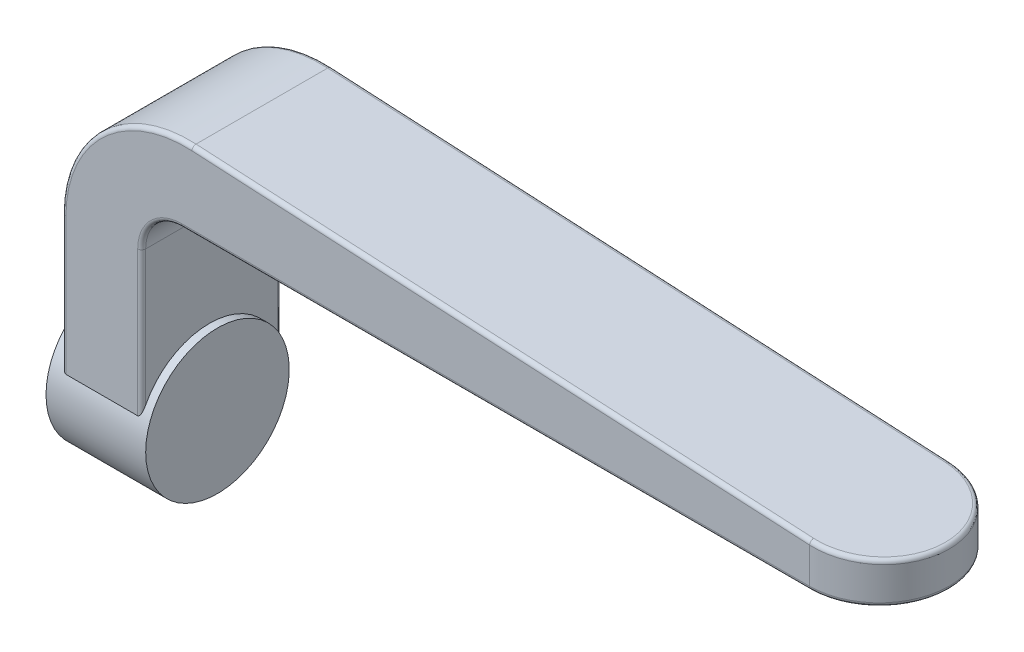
ISO-10303-21;
HEADER;
FILE_DESCRIPTION(('STEP AP214'),'2;1');
FILE_NAME('part.step','',(''),(''),'','','');
FILE_SCHEMA(('AUTOMOTIVE_DESIGN { 1 0 10303 214 1 1 1 1 }'));
ENDSEC;
DATA;
#1=APPLICATION_CONTEXT('core data for automotive mechanical design processes');
#2=APPLICATION_PROTOCOL_DEFINITION('international standard','automotive_design',2000,#1);
#3=PRODUCT_CONTEXT('',#1,'mechanical');
#4=PRODUCT('Part','Part','',(#3));
#5=PRODUCT_RELATED_PRODUCT_CATEGORY('part','',(#4));
#6=PRODUCT_DEFINITION_FORMATION('','',#4);
#7=PRODUCT_DEFINITION_CONTEXT('part definition',#1,'design');
#8=PRODUCT_DEFINITION('design','',#6,#7);
#9=PRODUCT_DEFINITION_SHAPE('','',#8);
#10=(LENGTH_UNIT() NAMED_UNIT(*) SI_UNIT(.MILLI.,.METRE.));
#11=(NAMED_UNIT(*) PLANE_ANGLE_UNIT() SI_UNIT($,.RADIAN.));
#12=(NAMED_UNIT(*) SI_UNIT($,.STERADIAN.) SOLID_ANGLE_UNIT());
#13=UNCERTAINTY_MEASURE_WITH_UNIT(LENGTH_MEASURE(1.E-05),#10,'distance_accuracy_value','');
#14=(GEOMETRIC_REPRESENTATION_CONTEXT(3) GLOBAL_UNCERTAINTY_ASSIGNED_CONTEXT((#13)) GLOBAL_UNIT_ASSIGNED_CONTEXT((#10,
#11,#12)) REPRESENTATION_CONTEXT('',''));
#15=CARTESIAN_POINT('',(0.,0.,0.));
#16=DIRECTION('',(0.,0.,1.));
#17=DIRECTION('',(1.,0.,0.));
#18=AXIS2_PLACEMENT_3D('',#15,#16,#17);
#19=CARTESIAN_POINT('',(0.,0.,70.));
#20=DIRECTION('',(0.,0.,-1.));
#21=DIRECTION('',(-1.,0.,0.));
#22=AXIS2_PLACEMENT_3D('',#19,#20,#21);
#23=PLANE('',#22);
#24=CARTESIAN_POINT('',(-251.522768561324,-16.7317817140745,70.));
#25=DIRECTION('',(0.,0.,-1.));
#26=DIRECTION('',(-1.,0.,0.));
#27=AXIS2_PLACEMENT_3D('',#24,#25,#26);
#28=CIRCLE('',#27,60.);
#29=CARTESIAN_POINT('',(-248.362610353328,43.1849388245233,70.));
#30=VERTEX_POINT('',#29);
#31=CARTESIAN_POINT('',(-311.522768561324,-16.7317817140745,70.));
#32=VERTEX_POINT('',#31);
#33=EDGE_CURVE('E378',#30,#32,#28,.F.);
#34=ORIENTED_EDGE('',*,*,#33,.T.);
#35=DIRECTION('',(0.,-1.,0.));
#36=VECTOR('',#35,1.);
#37=CARTESIAN_POINT('',(-311.522768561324,0.,70.));
#38=LINE('',#37,#36);
#39=CARTESIAN_POINT('',(-311.522768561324,-85.4964699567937,70.));
#40=VERTEX_POINT('',#39);
#41=EDGE_CURVE('E176',#32,#40,#38,.T.);
#42=ORIENTED_EDGE('',*,*,#41,.T.);
#43=DIRECTION('',(1.,0.,0.));
#44=VECTOR('',#43,1.);
#45=CARTESIAN_POINT('',(-319.522768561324,-85.4964699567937,70.));
#46=LINE('',#45,#44);
#47=CARTESIAN_POINT('',(-275.522768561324,-85.4964699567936,70.));
#48=VERTEX_POINT('',#47);
#49=EDGE_CURVE('E162',#48,#40,#46,.F.);
#50=ORIENTED_EDGE('',*,*,#49,.F.);
#51=DIRECTION('',(0.,1.,0.));
#52=VECTOR('',#51,1.);
#53=CARTESIAN_POINT('',(-275.522768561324,0.,70.));
#54=LINE('',#53,#52);
#55=CARTESIAN_POINT('',(-275.522768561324,-13.,70.));
#56=VERTEX_POINT('',#55);
#57=EDGE_CURVE('E173',#48,#56,#54,.T.);
#58=ORIENTED_EDGE('',*,*,#57,.T.);
#59=CARTESIAN_POINT('',(-253.522768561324,-13.,70.));
#60=DIRECTION('',(0.,0.,-1.));
#61=DIRECTION('',(-1.,0.,0.));
#62=AXIS2_PLACEMENT_3D('',#59,#60,#61);
#63=CIRCLE('',#62,22.);
#64=CARTESIAN_POINT('',(-253.522768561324,9.,70.));
#65=VERTEX_POINT('',#64);
#66=EDGE_CURVE('E184',#56,#65,#63,.T.);
#67=ORIENTED_EDGE('',*,*,#66,.T.);
#68=DIRECTION('',(1.,0.,0.));
#69=VECTOR('',#68,1.);
#70=CARTESIAN_POINT('',(0.,9.00000000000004,70.));
#71=LINE('',#70,#69);
#72=CARTESIAN_POINT('',(61.4772314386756,9.00000000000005,70.));
#73=VERTEX_POINT('',#72);
#74=EDGE_CURVE('E188',#65,#73,#71,.T.);
#75=ORIENTED_EDGE('',*,*,#74,.T.);
#76=DIRECTION('',(0.,1.,0.));
#77=VECTOR('',#76,1.);
#78=CARTESIAN_POINT('',(61.4772314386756,0.,70.));
#79=LINE('',#78,#77);
#80=CARTESIAN_POINT('',(61.4772314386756,26.8432079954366,70.));
#81=VERTEX_POINT('',#80);
#82=EDGE_CURVE('E439',#73,#81,#79,.T.);
#83=ORIENTED_EDGE('',*,*,#82,.T.);
#84=DIRECTION('',(-0.998612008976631,0.0526693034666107,0.));
#85=VECTOR('',#84,1.);
#86=CARTESIAN_POINT('',(1.58239196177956,30.0022121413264,70.));
#87=LINE('',#86,#85);
#88=EDGE_CURVE('E425',#81,#30,#87,.T.);
#89=ORIENTED_EDGE('',*,*,#88,.T.);
#90=EDGE_LOOP('',(#34,#42,#50,#58,#67,#75,#83,#89));
#91=FACE_BOUND('',#90,.T.);
#92=ADVANCED_FACE('F39',(#91),#23,.F.);
#93=CARTESIAN_POINT('',(-311.522768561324,48.6244289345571,2.));
#94=DIRECTION('',(0.,1.,0.));
#95=DIRECTION('',(0.,0.,1.));
#96=AXIS2_PLACEMENT_3D('',#93,#94,#95);
#97=CYLINDRICAL_SURFACE('',#96,2.);
#98=DIRECTION('',(0.,-1.,0.));
#99=VECTOR('',#98,1.);
#100=CARTESIAN_POINT('',(-313.522768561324,-97.3286295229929,2.));
#101=LINE('',#100,#99);
#102=CARTESIAN_POINT('',(-313.522768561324,-16.7317817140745,2.));
#103=VERTEX_POINT('',#102);
#104=CARTESIAN_POINT('',(-313.522768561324,-85.4964699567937,2.));
#105=VERTEX_POINT('',#104);
#106=EDGE_CURVE('E207',#103,#105,#101,.T.);
#107=ORIENTED_EDGE('',*,*,#106,.F.);
#108=CARTESIAN_POINT('',(-311.522768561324,-16.7317817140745,2.));
#109=DIRECTION('',(0.,1.,0.));
#110=DIRECTION('',(0.,0.,1.));
#111=AXIS2_PLACEMENT_3D('',#108,#109,#110);
#112=CIRCLE('',#111,2.);
#113=CARTESIAN_POINT('',(-311.522768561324,-16.7317817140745,0.));
#114=VERTEX_POINT('',#113);
#115=EDGE_CURVE('E359',#103,#114,#112,.F.);
#116=ORIENTED_EDGE('',*,*,#115,.T.);
#117=DIRECTION('',(0.,-1.,0.));
#118=VECTOR('',#117,1.);
#119=CARTESIAN_POINT('',(-311.522768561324,48.6244289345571,0.));
#120=LINE('',#119,#118);
#121=CARTESIAN_POINT('',(-311.522768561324,-95.3286295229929,0.));
#122=VERTEX_POINT('',#121);
#123=EDGE_CURVE('E219',#122,#114,#120,.F.);
#124=ORIENTED_EDGE('',*,*,#123,.F.);
#125=CARTESIAN_POINT('',(-311.522768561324,-95.3286295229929,2.));
#126=DIRECTION('',(-0.707106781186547,0.707106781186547,0.));
#127=DIRECTION('',(-0.707106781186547,-0.707106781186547,0.));
#128=AXIS2_PLACEMENT_3D('',#125,#126,#127);
#129=ELLIPSE('',#128,2.82842712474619,2.);
#130=CARTESIAN_POINT('',(-311.902922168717,-95.708783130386,0.0364615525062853));
#131=VERTEX_POINT('',#130);
#132=EDGE_CURVE('E250',#131,#122,#129,.F.);
#133=ORIENTED_EDGE('',*,*,#132,.F.);
#134=CARTESIAN_POINT('',(-311.522768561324,-97.3286295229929,0.));
#135=CARTESIAN_POINT('',(-311.522873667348,-97.3286295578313,0.));
#136=CARTESIAN_POINT('',(-311.522978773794,-97.3278986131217,8.22617000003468E-09));
#137=CARTESIAN_POINT('',(-311.523290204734,-97.3261101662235,5.71028239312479E-08));
#138=CARTESIAN_POINT('',(-311.523495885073,-97.3254229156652,1.21453794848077E-07));
#139=CARTESIAN_POINT('',(-311.5243174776,-97.3224194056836,5.05600308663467E-07));
#140=CARTESIAN_POINT('',(-311.524935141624,-97.3195832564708,1.07889411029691E-06));
#141=CARTESIAN_POINT('',(-311.527528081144,-97.3079706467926,4.68527953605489E-06));
#142=CARTESIAN_POINT('',(-311.529501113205,-97.299850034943,1.03552075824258E-05));
#143=CARTESIAN_POINT('',(-311.552676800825,-97.2040563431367,0.000111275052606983));
#144=CARTESIAN_POINT('',(-311.573892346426,-97.1123625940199,0.000541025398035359));
#145=CARTESIAN_POINT('',(-311.616647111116,-96.9295976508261,0.00208803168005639));
#146=CARTESIAN_POINT('',(-311.638185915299,-96.8385614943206,0.00321647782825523));
#147=CARTESIAN_POINT('',(-311.70061802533,-96.573891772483,0.00750140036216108));
#148=CARTESIAN_POINT('',(-311.741468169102,-96.3997258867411,0.0115690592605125));
#149=CARTESIAN_POINT('',(-311.828279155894,-96.0289393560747,0.0229255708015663));
#150=CARTESIAN_POINT('',(-311.874206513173,-95.8323741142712,0.0305673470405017));
#151=CARTESIAN_POINT('',(-311.966115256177,-95.4369031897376,0.0491880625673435));
#152=CARTESIAN_POINT('',(-312.01209122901,-95.2379965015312,0.0602042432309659));
#153=CARTESIAN_POINT('',(-312.089722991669,-94.899805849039,0.0817548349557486));
#154=CARTESIAN_POINT('',(-312.121546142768,-94.7604954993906,0.0914465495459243));
#155=CARTESIAN_POINT('',(-312.184724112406,-94.482275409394,0.112430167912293));
#156=CARTESIAN_POINT('',(-312.21607995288,-94.343365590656,0.123717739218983));
#157=CARTESIAN_POINT('',(-312.307846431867,-93.9339784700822,0.159379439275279));
#158=CARTESIAN_POINT('',(-312.367633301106,-93.6635623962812,0.186018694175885));
#159=CARTESIAN_POINT('',(-312.561875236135,-92.7691724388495,0.284380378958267));
#160=CARTESIAN_POINT('',(-312.691672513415,-92.1455484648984,0.369484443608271));
#161=CARTESIAN_POINT('',(-312.873207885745,-91.2084205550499,0.522618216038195));
#162=CARTESIAN_POINT('',(-312.931790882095,-90.8941547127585,0.578259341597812));
#163=CARTESIAN_POINT('',(-313.043205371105,-90.2662404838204,0.698090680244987));
#164=CARTESIAN_POINT('',(-313.09603730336,-89.9525920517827,0.762280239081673));
#165=CARTESIAN_POINT('',(-313.19908933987,-89.2984905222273,0.905291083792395));
#166=CARTESIAN_POINT('',(-313.248670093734,-88.9581084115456,0.984902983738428));
#167=CARTESIAN_POINT('',(-313.337727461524,-88.2785096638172,1.15436936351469));
#168=CARTESIAN_POINT('',(-313.377202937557,-87.9392931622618,1.24422499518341));
#169=CARTESIAN_POINT('',(-313.443579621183,-87.2636909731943,1.43383627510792));
#170=CARTESIAN_POINT('',(-313.470525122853,-86.927299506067,1.53355551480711));
#171=CARTESIAN_POINT('',(-313.509056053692,-86.2568307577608,1.74305152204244));
#172=CARTESIAN_POINT('',(-313.520647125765,-85.9227526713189,1.85282457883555));
#173=CARTESIAN_POINT('',(-313.523656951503,-85.3839773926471,2.03865499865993));
#174=CARTESIAN_POINT('',(-313.52105977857,-85.1782726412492,2.11170652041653));
#175=CARTESIAN_POINT('',(-313.50703058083,-84.7683737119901,2.26148207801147));
#176=CARTESIAN_POINT('',(-313.495594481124,-84.5641802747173,2.33820779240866));
#177=CARTESIAN_POINT('',(-313.462424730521,-84.1608427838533,2.493949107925));
#178=CARTESIAN_POINT('',(-313.440840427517,-83.9616682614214,2.5729163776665));
#179=CARTESIAN_POINT('',(-313.385260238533,-83.5663201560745,2.73373556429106));
#180=CARTESIAN_POINT('',(-313.351271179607,-83.3701449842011,2.81558587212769));
#181=CARTESIAN_POINT('',(-313.270449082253,-82.9941972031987,2.9763251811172));
#182=CARTESIAN_POINT('',(-313.224561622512,-82.8141705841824,3.05507523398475));
#183=CARTESIAN_POINT('',(-313.142634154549,-82.5480590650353,3.174030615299));
#184=CARTESIAN_POINT('',(-313.113065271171,-82.4598263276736,3.2139065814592));
#185=CARTESIAN_POINT('',(-313.048896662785,-82.2852056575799,3.29366124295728));
#186=CARTESIAN_POINT('',(-313.014297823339,-82.198817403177,3.33353993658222));
#187=CARTESIAN_POINT('',(-312.94544314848,-82.0424884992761,3.40644142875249));
#188=CARTESIAN_POINT('',(-312.912069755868,-81.9721827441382,3.4395114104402));
#189=CARTESIAN_POINT('',(-312.840662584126,-81.8337502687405,3.50516073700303));
#190=CARTESIAN_POINT('',(-312.802630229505,-81.7656228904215,3.53774022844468));
#191=CARTESIAN_POINT('',(-312.721336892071,-81.6324832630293,3.60190700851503));
#192=CARTESIAN_POINT('',(-312.678097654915,-81.5674595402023,3.63349777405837));
#193=CARTESIAN_POINT('',(-312.585436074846,-81.4412961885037,3.69523938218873));
#194=CARTESIAN_POINT('',(-312.536020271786,-81.3801525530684,3.72539170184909));
#195=CARTESIAN_POINT('',(-312.435952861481,-81.269823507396,3.78015977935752));
#196=CARTESIAN_POINT('',(-312.386071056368,-81.2200674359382,3.80501623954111));
#197=CARTESIAN_POINT('',(-312.279822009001,-81.126320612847,3.85209281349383));
#198=CARTESIAN_POINT('',(-312.223447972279,-81.0823360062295,3.87431011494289));
#199=CARTESIAN_POINT('',(-312.102922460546,-81.0019680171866,3.91507860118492));
#200=CARTESIAN_POINT('',(-312.038673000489,-80.965699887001,3.93357400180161));
#201=CARTESIAN_POINT('',(-311.903519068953,-80.9049763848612,3.96463203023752));
#202=CARTESIAN_POINT('',(-311.832638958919,-80.8804796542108,3.97721542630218));
#203=CARTESIAN_POINT('',(-311.708729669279,-80.8517400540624,3.99199651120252));
#204=CARTESIAN_POINT('',(-311.65683653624,-80.8436013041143,3.99618987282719));
#205=CARTESIAN_POINT('',(-311.55224460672,-80.835303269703,4.00046539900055));
#206=CARTESIAN_POINT('',(-311.499546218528,-80.8351400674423,4.0005495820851));
#207=CARTESIAN_POINT('',(-311.394964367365,-80.842808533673,3.99659827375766));
#208=CARTESIAN_POINT('',(-311.34308010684,-80.8506318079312,3.99256710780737));
#209=CARTESIAN_POINT('',(-311.241396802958,-80.8735634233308,3.98077197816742));
#210=CARTESIAN_POINT('',(-311.191599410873,-80.8886774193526,3.97300511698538));
#211=CARTESIAN_POINT('',(-311.077517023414,-80.9316885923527,3.95095798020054));
#212=CARTESIAN_POINT('',(-311.014494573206,-80.9622310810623,3.93533842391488));
#213=CARTESIAN_POINT('',(-310.894729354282,-81.0319142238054,3.89986592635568));
#214=CARTESIAN_POINT('',(-310.838000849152,-81.0710738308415,3.88000365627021));
#215=CARTESIAN_POINT('',(-310.698143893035,-81.1811936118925,3.82444991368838));
#216=CARTESIAN_POINT('',(-310.619830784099,-81.257051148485,3.78645638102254));
#217=CARTESIAN_POINT('',(-310.476426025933,-81.4184437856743,3.70643730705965));
#218=CARTESIAN_POINT('',(-310.411372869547,-81.504005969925,3.66440053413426));
#219=CARTESIAN_POINT('',(-310.293304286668,-81.6794955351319,3.57911261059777));
#220=CARTESIAN_POINT('',(-310.240072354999,-81.7692999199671,3.53590310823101));
#221=CARTESIAN_POINT('',(-310.142115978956,-81.9530237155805,3.44848514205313));
#222=CARTESIAN_POINT('',(-310.097399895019,-82.0469470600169,3.40427574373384));
#223=CARTESIAN_POINT('',(-310.015107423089,-82.2376916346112,3.31552869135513));
#224=CARTESIAN_POINT('',(-309.977531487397,-82.3345130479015,3.27099101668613));
#225=CARTESIAN_POINT('',(-309.908454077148,-82.5302728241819,3.18201406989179));
#226=CARTESIAN_POINT('',(-309.876950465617,-82.6292104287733,3.13757476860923));
#227=CARTESIAN_POINT('',(-309.815369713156,-82.8418189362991,3.04324716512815));
#228=CARTESIAN_POINT('',(-309.78602084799,-82.95572113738,2.99340816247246));
#229=CARTESIAN_POINT('',(-309.733040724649,-83.1851678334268,2.89443987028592));
#230=CARTESIAN_POINT('',(-309.709410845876,-83.300712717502,2.84531075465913));
#231=CARTESIAN_POINT('',(-309.667112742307,-83.5331902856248,2.74790601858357));
#232=CARTESIAN_POINT('',(-309.648449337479,-83.6501242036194,2.69963126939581));
#233=CARTESIAN_POINT('',(-309.61551812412,-83.8850305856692,2.60410601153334));
#234=CARTESIAN_POINT('',(-309.601250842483,-84.0030031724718,2.55685562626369));
#235=CARTESIAN_POINT('',(-309.56392232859,-84.3617053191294,2.41539708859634));
#236=CARTESIAN_POINT('',(-309.546931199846,-84.603765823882,2.32293010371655));
#237=CARTESIAN_POINT('',(-309.525855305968,-85.0900631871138,2.14317351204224));
#238=CARTESIAN_POINT('',(-309.521760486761,-85.3342982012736,2.05587992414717));
#239=CARTESIAN_POINT('',(-309.524462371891,-85.8794930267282,1.86763966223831));
#240=CARTESIAN_POINT('',(-309.53390636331,-86.1808956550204,1.76801899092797));
#241=CARTESIAN_POINT('',(-309.565627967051,-86.7856487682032,1.57695279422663));
#242=CARTESIAN_POINT('',(-309.587909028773,-87.0889997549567,1.48550947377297));
#243=CARTESIAN_POINT('',(-309.643090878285,-87.6980753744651,1.31061930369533));
#244=CARTESIAN_POINT('',(-309.676025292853,-88.0038044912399,1.22719887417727));
#245=CARTESIAN_POINT('',(-309.750664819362,-88.616301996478,1.06870420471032));
#246=CARTESIAN_POINT('',(-309.792369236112,-88.9230703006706,0.993629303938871));
#247=CARTESIAN_POINT('',(-309.921402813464,-89.7974025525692,0.79177114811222));
#248=CARTESIAN_POINT('',(-310.01747873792,-90.3660069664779,0.674984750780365));
#249=CARTESIAN_POINT('',(-310.226076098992,-91.4997781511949,0.470387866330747));
#250=CARTESIAN_POINT('',(-310.338439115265,-92.0649288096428,0.382322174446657));
#251=CARTESIAN_POINT('',(-310.49050882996,-92.7928244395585,0.286511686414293));
#252=CARTESIAN_POINT('',(-310.524883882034,-92.9551163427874,0.266275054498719));
#253=CARTESIAN_POINT('',(-310.59445665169,-93.2796579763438,0.228048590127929));
#254=CARTESIAN_POINT('',(-310.629653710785,-93.4419076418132,0.210057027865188));
#255=CARTESIAN_POINT('',(-310.701728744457,-93.7707848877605,0.175849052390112));
#256=CARTESIAN_POINT('',(-310.738626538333,-93.9374143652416,0.159692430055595));
#257=CARTESIAN_POINT('',(-310.813185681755,-94.2711755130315,0.129676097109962));
#258=CARTESIAN_POINT('',(-310.850848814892,-94.438307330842,0.115822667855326));
#259=CARTESIAN_POINT('',(-310.942606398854,-94.8425892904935,0.0851549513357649));
#260=CARTESIAN_POINT('',(-310.996982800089,-95.0797788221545,0.069526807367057));
#261=CARTESIAN_POINT('',(-311.10592869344,-95.551375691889,0.0431273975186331));
#262=CARTESIAN_POINT('',(-311.160488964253,-95.7857840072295,0.0323029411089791));
#263=CARTESIAN_POINT('',(-311.263756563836,-96.2279529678,0.0162367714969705));
#264=CARTESIAN_POINT('',(-311.312407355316,-96.4356451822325,0.0104925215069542));
#265=CARTESIAN_POINT('',(-311.386812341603,-96.7512688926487,0.00446032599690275));
#266=CARTESIAN_POINT('',(-311.412493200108,-96.8598416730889,0.00287668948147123));
#267=CARTESIAN_POINT('',(-311.463475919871,-97.0778357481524,0.000719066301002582));
#268=CARTESIAN_POINT('',(-311.488777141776,-97.1872144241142,0.000129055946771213));
#269=CARTESIAN_POINT('',(-311.516036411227,-97.2998489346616,1.03534224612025E-05));
#270=CARTESIAN_POINT('',(-311.518009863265,-97.307973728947,4.68292143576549E-06));
#271=CARTESIAN_POINT('',(-311.520602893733,-97.3195871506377,1.07800250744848E-06));
#272=CARTESIAN_POINT('',(-311.521220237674,-97.3224216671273,5.0523696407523E-07));
#273=CARTESIAN_POINT('',(-311.522041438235,-97.325423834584,1.2138920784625E-07));
#274=CARTESIAN_POINT('',(-311.522247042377,-97.3261108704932,5.70790345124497E-08));
#275=CARTESIAN_POINT('',(-311.522558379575,-97.3278986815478,8.22384181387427E-09));
#276=CARTESIAN_POINT('',(-311.522663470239,-97.3286294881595,0.));
#277=CARTESIAN_POINT('',(-311.522768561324,-97.3286295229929,0.));
#278=B_SPLINE_CURVE_WITH_KNOTS('',3,(#134,#135,#136,#137,#138,#139,#140,#141,#142,#143,#144,
#145,#146,#147,#148,#149,#150,#151,#152,#153,#154,#155,#156,#157,#158,#159,#160,#161,#162,#163,
#164,#165,#166,#167,#168,#169,#170,#171,#172,#173,#174,#175,#176,#177,#178,#179,#180,#181,#182,
#183,#184,#185,#186,#187,#188,#189,#190,#191,#192,#193,#194,#195,#196,#197,#198,#199,#200,#201,
#202,#203,#204,#205,#206,#207,#208,#209,#210,#211,#212,#213,#214,#215,#216,#217,#218,#219,#220,
#221,#222,#223,#224,#225,#226,#227,#228,#229,#230,#231,#232,#233,#234,#235,#236,#237,#238,#239,
#240,#241,#242,#243,#244,#245,#246,#247,#248,#249,#250,#251,#252,#253,#254,#255,#256,#257,#258,
#259,#260,#261,#262,#263,#264,#265,#266,#267,#268,#269,#270,#271,#272,#273,#274,#275,#276,#277),
.UNSPECIFIED.,.T.,.F.,(4,2,2,2,2,2,2,2,2,2,2,2,2,2,2,2,2,2,2,2,2,2,2,2,2,2,2,2,2,2,2,2,2,2,2,2,
2,2,2,2,2,2,2,2,2,2,2,2,2,2,2,2,2,2,2,2,2,2,2,2,2,2,2,2,2,2,2,2,2,2,2,4),(0.,
0.00136994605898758,0.00406781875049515,0.0121350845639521,0.0379473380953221,0.315314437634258,
0.597243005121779,1.13313624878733,1.73941867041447,2.35264929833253,2.78233445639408,
3.21087472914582,4.04550331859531,5.97219959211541,6.94553218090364,7.91879031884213,
8.97772614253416,10.0367811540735,11.0920633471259,12.1469576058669,12.8017023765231,
13.4567491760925,14.1024439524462,14.747783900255,15.3524107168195,15.6560196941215,
15.9595752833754,16.213124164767,16.4665957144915,16.7190431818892,16.9712255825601,
17.1949283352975,17.4188673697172,17.6459469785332,17.8722228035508,18.0296009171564,
18.1869017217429,18.3440373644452,18.5012950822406,18.7153442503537,18.9298690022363,
19.2742992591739,19.6197155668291,19.9581586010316,20.2969322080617,20.6357272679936,
20.974402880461,21.3574720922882,21.740633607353,22.1241656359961,22.5077436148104,
23.2862525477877,24.0641543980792,25.0164360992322,25.9689738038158,26.9245479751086,
27.8800464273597,29.6440211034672,31.3918650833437,31.8932223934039,32.3941909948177,
32.9084563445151,33.4241019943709,34.1554821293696,34.8785483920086,35.51759939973,
35.853859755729,36.1846435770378,36.2104611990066,36.2185243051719,36.2212211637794,
36.2225909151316),.UNSPECIFIED.);
#279=EDGE_CURVE('E233',#131,#105,#278,.T.);
#280=ORIENTED_EDGE('',*,*,#279,.T.);
#281=EDGE_LOOP('',(#107,#116,#124,#133,#280));
#282=FACE_BOUND('',#281,.T.);
#283=ADVANCED_FACE('F346',(#282),#97,.T.);
#284=CARTESIAN_POINT('',(-313.522768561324,-95.3286295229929,2.));
#285=DIRECTION('',(-1.,0.,0.));
#286=DIRECTION('',(0.,0.,1.));
#287=AXIS2_PLACEMENT_3D('',#284,#285,#286);
#288=CYLINDRICAL_SURFACE('',#287,2.);
#289=CARTESIAN_POINT('',(-275.522768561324,-95.3286295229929,2.));
#290=DIRECTION('',(-0.707106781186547,-0.707106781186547,0.));
#291=DIRECTION('',(0.707106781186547,-0.707106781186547,0.));
#292=AXIS2_PLACEMENT_3D('',#289,#290,#291);
#293=ELLIPSE('',#292,2.82842712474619,2.);
#294=CARTESIAN_POINT('',(-275.142614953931,-95.708783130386,0.0364615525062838));
#295=VERTEX_POINT('',#294);
#296=CARTESIAN_POINT('',(-275.522768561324,-95.3286295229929,0.));
#297=VERTEX_POINT('',#296);
#298=EDGE_CURVE('E248',#295,#297,#293,.F.);
#299=ORIENTED_EDGE('',*,*,#298,.F.);
#300=DIRECTION('',(1.,0.,0.));
#301=VECTOR('',#300,1.);
#302=CARTESIAN_POINT('',(-293.522768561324,-95.708783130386,0.0364615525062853));
#303=LINE('',#302,#301);
#304=EDGE_CURVE('E326',#295,#131,#303,.F.);
#305=ORIENTED_EDGE('',*,*,#304,.T.);
#306=ORIENTED_EDGE('',*,*,#132,.T.);
#307=DIRECTION('',(1.,0.,0.));
#308=VECTOR('',#307,1.);
#309=CARTESIAN_POINT('',(-313.522768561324,-95.3286295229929,0.));
#310=LINE('',#309,#308);
#311=EDGE_CURVE('E222',#297,#122,#310,.F.);
#312=ORIENTED_EDGE('',*,*,#311,.F.);
#313=EDGE_LOOP('',(#299,#305,#306,#312));
#314=FACE_BOUND('',#313,.T.);
#315=ADVANCED_FACE('F316',(#314),#288,.T.);
#316=CARTESIAN_POINT('',(-275.522768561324,7.,2.));
#317=DIRECTION('',(0.,-1.,0.));
#318=DIRECTION('',(0.,0.,-1.));
#319=AXIS2_PLACEMENT_3D('',#316,#317,#318);
#320=CYLINDRICAL_SURFACE('',#319,2.);
#321=DIRECTION('',(0.,1.,0.));
#322=VECTOR('',#321,1.);
#323=CARTESIAN_POINT('',(-273.522768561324,-13.,2.));
#324=LINE('',#323,#322);
#325=CARTESIAN_POINT('',(-273.522768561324,-85.4964699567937,2.));
#326=VERTEX_POINT('',#325);
#327=CARTESIAN_POINT('',(-273.522768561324,-13.,2.));
#328=VERTEX_POINT('',#327);
#329=EDGE_CURVE('E183',#326,#328,#324,.T.);
#330=ORIENTED_EDGE('',*,*,#329,.F.);
#331=CARTESIAN_POINT('',(-275.522768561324,-97.3286295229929,0.));
#332=CARTESIAN_POINT('',(-275.522873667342,-97.3286295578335,0.));
#333=CARTESIAN_POINT('',(-275.522978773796,-97.3278986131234,8.22617162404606E-09));
#334=CARTESIAN_POINT('',(-275.523290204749,-97.3261101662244,5.71028241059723E-08));
#335=CARTESIAN_POINT('',(-275.52349588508,-97.325422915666,1.2145379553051E-07));
#336=CARTESIAN_POINT('',(-275.524317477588,-97.3224194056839,5.05600310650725E-07));
#337=CARTESIAN_POINT('',(-275.52493514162,-97.319583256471,1.07889411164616E-06));
#338=CARTESIAN_POINT('',(-275.52752808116,-97.3079706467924,4.68527953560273E-06));
#339=CARTESIAN_POINT('',(-275.529501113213,-97.299850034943,1.03552075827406E-05));
#340=CARTESIAN_POINT('',(-275.552676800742,-97.2040563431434,0.000111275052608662));
#341=CARTESIAN_POINT('',(-275.573892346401,-97.1123625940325,0.000541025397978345));
#342=CARTESIAN_POINT('',(-275.616647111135,-96.9295976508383,0.00208803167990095));
#343=CARTESIAN_POINT('',(-275.638185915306,-96.8385614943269,0.00321647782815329));
#344=CARTESIAN_POINT('',(-275.700618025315,-96.5738917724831,0.00750140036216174));
#345=CARTESIAN_POINT('',(-275.741468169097,-96.3997258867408,0.0115690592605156));
#346=CARTESIAN_POINT('',(-275.828279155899,-96.0289393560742,0.0229255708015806));
#347=CARTESIAN_POINT('',(-275.874206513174,-95.8323741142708,0.0305673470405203));
#348=CARTESIAN_POINT('',(-275.966115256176,-95.4369031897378,0.04918806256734));
#349=CARTESIAN_POINT('',(-276.01209122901,-95.2379965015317,0.0602042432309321));
#350=CARTESIAN_POINT('',(-276.089722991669,-94.8998058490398,0.0817548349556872));
#351=CARTESIAN_POINT('',(-276.121546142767,-94.7604954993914,0.0914465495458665));
#352=CARTESIAN_POINT('',(-276.184724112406,-94.4822754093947,0.112430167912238));
#353=CARTESIAN_POINT('',(-276.21607995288,-94.3433655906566,0.123717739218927));
#354=CARTESIAN_POINT('',(-276.307846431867,-93.9339784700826,0.159379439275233));
#355=CARTESIAN_POINT('',(-276.367633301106,-93.6635623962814,0.186018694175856));
#356=CARTESIAN_POINT('',(-276.561875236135,-92.7691724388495,0.284380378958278));
#357=CARTESIAN_POINT('',(-276.691672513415,-92.1455484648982,0.369484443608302));
#358=CARTESIAN_POINT('',(-276.873207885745,-91.2084205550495,0.522618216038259));
#359=CARTESIAN_POINT('',(-276.931790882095,-90.8941547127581,0.578259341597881));
#360=CARTESIAN_POINT('',(-277.043205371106,-90.2662404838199,0.698090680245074));
#361=CARTESIAN_POINT('',(-277.09603730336,-89.9525920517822,0.762280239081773));
#362=CARTESIAN_POINT('',(-277.19908933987,-89.2984905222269,0.905291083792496));
#363=CARTESIAN_POINT('',(-277.248670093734,-88.9581084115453,0.984902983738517));
#364=CARTESIAN_POINT('',(-277.337727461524,-88.278509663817,1.15436936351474));
#365=CARTESIAN_POINT('',(-277.377202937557,-87.9392931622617,1.24422499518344));
#366=CARTESIAN_POINT('',(-277.443579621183,-87.2636909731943,1.43383627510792));
#367=CARTESIAN_POINT('',(-277.470525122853,-86.927299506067,1.53355551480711));
#368=CARTESIAN_POINT('',(-277.509056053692,-86.2568307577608,1.74305152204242));
#369=CARTESIAN_POINT('',(-277.520647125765,-85.9227526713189,1.85282457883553));
#370=CARTESIAN_POINT('',(-277.523656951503,-85.3839773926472,2.0386549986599));
#371=CARTESIAN_POINT('',(-277.52105977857,-85.1782726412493,2.1117065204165));
#372=CARTESIAN_POINT('',(-277.50703058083,-84.7683737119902,2.26148207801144));
#373=CARTESIAN_POINT('',(-277.495594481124,-84.5641802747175,2.33820779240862));
#374=CARTESIAN_POINT('',(-277.462424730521,-84.1608427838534,2.49394910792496));
#375=CARTESIAN_POINT('',(-277.440840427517,-83.9616682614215,2.57291637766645));
#376=CARTESIAN_POINT('',(-277.385260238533,-83.5663201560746,2.73373556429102));
#377=CARTESIAN_POINT('',(-277.351271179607,-83.3701449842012,2.81558587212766));
#378=CARTESIAN_POINT('',(-277.270449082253,-82.9941972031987,2.97632518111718));
#379=CARTESIAN_POINT('',(-277.224561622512,-82.8141705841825,3.05507523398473));
#380=CARTESIAN_POINT('',(-277.142634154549,-82.5480590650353,3.17403061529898));
#381=CARTESIAN_POINT('',(-277.113065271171,-82.4598263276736,3.21390658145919));
#382=CARTESIAN_POINT('',(-277.048896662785,-82.2852056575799,3.29366124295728));
#383=CARTESIAN_POINT('',(-277.014297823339,-82.198817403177,3.33353993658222));
#384=CARTESIAN_POINT('',(-276.94544314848,-82.0424884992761,3.40644142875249));
#385=CARTESIAN_POINT('',(-276.912069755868,-81.9721827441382,3.4395114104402));
#386=CARTESIAN_POINT('',(-276.840662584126,-81.8337502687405,3.50516073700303));
#387=CARTESIAN_POINT('',(-276.802630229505,-81.7656228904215,3.53774022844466));
#388=CARTESIAN_POINT('',(-276.721336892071,-81.6324832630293,3.60190700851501));
#389=CARTESIAN_POINT('',(-276.678097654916,-81.5674595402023,3.63349777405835));
#390=CARTESIAN_POINT('',(-276.585436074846,-81.4412961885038,3.69523938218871));
#391=CARTESIAN_POINT('',(-276.536020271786,-81.3801525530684,3.72539170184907));
#392=CARTESIAN_POINT('',(-276.435952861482,-81.2698235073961,3.7801597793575));
#393=CARTESIAN_POINT('',(-276.386071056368,-81.2200674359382,3.80501623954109));
#394=CARTESIAN_POINT('',(-276.279822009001,-81.126320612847,3.85209281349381));
#395=CARTESIAN_POINT('',(-276.223447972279,-81.0823360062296,3.87431011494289));
#396=CARTESIAN_POINT('',(-276.102922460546,-81.0019680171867,3.91507860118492));
#397=CARTESIAN_POINT('',(-276.03867300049,-80.9656998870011,3.9335740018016));
#398=CARTESIAN_POINT('',(-275.903519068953,-80.9049763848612,3.96463203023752));
#399=CARTESIAN_POINT('',(-275.832638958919,-80.8804796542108,3.97721542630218));
#400=CARTESIAN_POINT('',(-275.708729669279,-80.8517400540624,3.99199651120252));
#401=CARTESIAN_POINT('',(-275.65683653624,-80.8436013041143,3.99618987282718));
#402=CARTESIAN_POINT('',(-275.55224460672,-80.835303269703,4.00046539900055));
#403=CARTESIAN_POINT('',(-275.499546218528,-80.8351400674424,4.0005495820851));
#404=CARTESIAN_POINT('',(-275.394964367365,-80.842808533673,3.99659827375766));
#405=CARTESIAN_POINT('',(-275.34308010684,-80.8506318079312,3.99256710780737));
#406=CARTESIAN_POINT('',(-275.241396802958,-80.8735634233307,3.98077197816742));
#407=CARTESIAN_POINT('',(-275.191599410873,-80.8886774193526,3.97300511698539));
#408=CARTESIAN_POINT('',(-275.077517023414,-80.9316885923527,3.95095798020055));
#409=CARTESIAN_POINT('',(-275.014494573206,-80.9622310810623,3.9353384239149));
#410=CARTESIAN_POINT('',(-274.894729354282,-81.0319142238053,3.89986592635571));
#411=CARTESIAN_POINT('',(-274.838000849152,-81.0710738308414,3.88000365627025));
#412=CARTESIAN_POINT('',(-274.698143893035,-81.1811936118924,3.82444991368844));
#413=CARTESIAN_POINT('',(-274.619830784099,-81.2570511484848,3.78645638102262));
#414=CARTESIAN_POINT('',(-274.476426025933,-81.4184437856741,3.70643730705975));
#415=CARTESIAN_POINT('',(-274.411372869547,-81.5040059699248,3.66440053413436));
#416=CARTESIAN_POINT('',(-274.293304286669,-81.6794955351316,3.5791126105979));
#417=CARTESIAN_POINT('',(-274.240072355,-81.7692999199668,3.53590310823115));
#418=CARTESIAN_POINT('',(-274.142115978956,-81.9530237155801,3.4484851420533));
#419=CARTESIAN_POINT('',(-274.097399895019,-82.0469470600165,3.40427574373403));
#420=CARTESIAN_POINT('',(-274.015107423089,-82.2376916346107,3.31552869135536));
#421=CARTESIAN_POINT('',(-273.977531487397,-82.334513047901,3.27099101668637));
#422=CARTESIAN_POINT('',(-273.908454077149,-82.5302728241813,3.18201406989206));
#423=CARTESIAN_POINT('',(-273.876950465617,-82.6292104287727,3.13757476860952));
#424=CARTESIAN_POINT('',(-273.815369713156,-82.8418189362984,3.04324716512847));
#425=CARTESIAN_POINT('',(-273.78602084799,-82.9557211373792,2.99340816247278));
#426=CARTESIAN_POINT('',(-273.733040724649,-83.185167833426,2.89443987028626));
#427=CARTESIAN_POINT('',(-273.709410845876,-83.3007127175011,2.84531075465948));
#428=CARTESIAN_POINT('',(-273.667112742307,-83.5331902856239,2.74790601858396));
#429=CARTESIAN_POINT('',(-273.64844933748,-83.6501242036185,2.6996312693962));
#430=CARTESIAN_POINT('',(-273.61551812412,-83.8850305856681,2.60410601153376));
#431=CARTESIAN_POINT('',(-273.601250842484,-84.0030031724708,2.55685562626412));
#432=CARTESIAN_POINT('',(-273.56392232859,-84.3617053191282,2.41539708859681));
#433=CARTESIAN_POINT('',(-273.546931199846,-84.6037658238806,2.32293010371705));
#434=CARTESIAN_POINT('',(-273.525855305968,-85.0900631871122,2.14317351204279));
#435=CARTESIAN_POINT('',(-273.521760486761,-85.334298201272,2.05587992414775));
#436=CARTESIAN_POINT('',(-273.524462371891,-85.8794930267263,1.86763966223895));
#437=CARTESIAN_POINT('',(-273.53390636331,-86.1808956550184,1.76801899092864));
#438=CARTESIAN_POINT('',(-273.565627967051,-86.7856487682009,1.57695279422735));
#439=CARTESIAN_POINT('',(-273.587909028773,-87.0889997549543,1.48550947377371));
#440=CARTESIAN_POINT('',(-273.643090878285,-87.6980753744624,1.3106193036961));
#441=CARTESIAN_POINT('',(-273.676025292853,-88.003804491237,1.22719887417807));
#442=CARTESIAN_POINT('',(-273.750664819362,-88.6163019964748,1.06870420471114));
#443=CARTESIAN_POINT('',(-273.792369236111,-88.9230703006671,0.993629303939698));
#444=CARTESIAN_POINT('',(-273.921402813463,-89.7974025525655,0.79177114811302));
#445=CARTESIAN_POINT('',(-274.017478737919,-90.366006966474,0.674984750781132));
#446=CARTESIAN_POINT('',(-274.226076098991,-91.4997781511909,0.470387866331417));
#447=CARTESIAN_POINT('',(-274.338439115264,-92.0649288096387,0.382322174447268));
#448=CARTESIAN_POINT('',(-274.490508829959,-92.7928244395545,0.286511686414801));
#449=CARTESIAN_POINT('',(-274.524883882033,-92.9551163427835,0.266275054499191));
#450=CARTESIAN_POINT('',(-274.594456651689,-93.2796579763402,0.228048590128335));
#451=CARTESIAN_POINT('',(-274.629653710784,-93.4419076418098,0.210057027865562));
#452=CARTESIAN_POINT('',(-274.701728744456,-93.7707848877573,0.175849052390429));
#453=CARTESIAN_POINT('',(-274.738626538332,-93.9374143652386,0.159692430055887));
#454=CARTESIAN_POINT('',(-274.813185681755,-94.2711755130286,0.12967609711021));
#455=CARTESIAN_POINT('',(-274.850848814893,-94.4383073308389,0.115822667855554));
#456=CARTESIAN_POINT('',(-274.942606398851,-94.8425892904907,0.085154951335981));
#457=CARTESIAN_POINT('',(-274.99698280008,-95.0797788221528,0.0695268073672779));
#458=CARTESIAN_POINT('',(-275.105928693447,-95.5513756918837,0.0431273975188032));
#459=CARTESIAN_POINT('',(-275.160488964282,-95.7857840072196,0.0323029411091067));
#460=CARTESIAN_POINT('',(-275.263756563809,-96.2279529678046,0.0162367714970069));
#461=CARTESIAN_POINT('',(-275.312407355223,-96.4356451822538,0.0104925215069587));
#462=CARTESIAN_POINT('',(-275.386812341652,-96.7512688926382,0.00446032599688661));
#463=CARTESIAN_POINT('',(-275.412493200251,-96.8598416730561,0.00287668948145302));
#464=CARTESIAN_POINT('',(-275.463475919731,-97.0778357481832,0.000719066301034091));
#465=CARTESIAN_POINT('',(-275.488777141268,-97.1872144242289,0.000129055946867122));
#466=CARTESIAN_POINT('',(-275.516036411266,-97.2998489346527,1.0353422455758E-05));
#467=CARTESIAN_POINT('',(-275.518009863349,-97.3079737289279,4.68292142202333E-06));
#468=CARTESIAN_POINT('',(-275.520602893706,-97.3195871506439,1.0780025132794E-06));
#469=CARTESIAN_POINT('',(-275.521220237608,-97.3224216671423,5.05236976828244E-07));
#470=CARTESIAN_POINT('',(-275.522041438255,-97.3254238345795,1.21389204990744E-07));
#471=CARTESIAN_POINT('',(-275.522247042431,-97.3261108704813,5.70790256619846E-08));
#472=CARTESIAN_POINT('',(-275.522558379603,-97.3278986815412,8.22383749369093E-09));
#473=CARTESIAN_POINT('',(-275.522663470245,-97.3286294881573,0.));
#474=CARTESIAN_POINT('',(-275.522768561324,-97.3286295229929,0.));
#475=B_SPLINE_CURVE_WITH_KNOTS('',3,(#331,#332,#333,#334,#335,#336,#337,#338,#339,#340,#341,
#342,#343,#344,#345,#346,#347,#348,#349,#350,#351,#352,#353,#354,#355,#356,#357,#358,#359,#360,
#361,#362,#363,#364,#365,#366,#367,#368,#369,#370,#371,#372,#373,#374,#375,#376,#377,#378,#379,
#380,#381,#382,#383,#384,#385,#386,#387,#388,#389,#390,#391,#392,#393,#394,#395,#396,#397,#398,
#399,#400,#401,#402,#403,#404,#405,#406,#407,#408,#409,#410,#411,#412,#413,#414,#415,#416,#417,
#418,#419,#420,#421,#422,#423,#424,#425,#426,#427,#428,#429,#430,#431,#432,#433,#434,#435,#436,
#437,#438,#439,#440,#441,#442,#443,#444,#445,#446,#447,#448,#449,#450,#451,#452,#453,#454,#455,
#456,#457,#458,#459,#460,#461,#462,#463,#464,#465,#466,#467,#468,#469,#470,#471,#472,#473,#474),
.UNSPECIFIED.,.T.,.F.,(4,2,2,2,2,2,2,2,2,2,2,2,2,2,2,2,2,2,2,2,2,2,2,2,2,2,2,2,2,2,2,2,2,2,2,2,
2,2,2,2,2,2,2,2,2,2,2,2,2,2,2,2,2,2,2,2,2,2,2,2,2,2,2,2,2,2,2,2,2,2,2,4),(0.,
0.00136994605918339,0.00406781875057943,0.0121350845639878,0.037947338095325,0.315314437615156,
0.597243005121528,1.13313624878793,1.73941867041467,2.35264929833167,2.78233445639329,
3.21087472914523,4.0455033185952,5.97219959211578,6.94553218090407,7.91879031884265,
8.97772614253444,10.0367811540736,11.0920633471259,12.1469576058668,12.801702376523,
13.4567491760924,14.1024439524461,14.7477839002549,15.3524107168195,15.6560196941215,
15.9595752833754,16.213124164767,16.4665957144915,16.7190431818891,16.9712255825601,
17.1949283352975,17.4188673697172,17.6459469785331,17.8722228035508,18.0296009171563,
18.1869017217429,18.3440373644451,18.5012950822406,18.7153442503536,18.9298690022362,
19.2742992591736,19.6197155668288,19.9581586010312,20.2969322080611,20.635727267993,
20.9744028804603,21.3574720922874,21.740633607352,22.1241656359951,22.5077436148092,
23.2862525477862,24.0641543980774,25.0164360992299,25.968973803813,26.9245479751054,
27.880046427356,29.6440211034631,31.3918650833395,31.8932223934,32.3941909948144,
32.9084563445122,33.424101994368,34.1554821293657,34.8785483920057,35.5175993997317,
35.8538597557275,36.1846435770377,36.2104611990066,36.218524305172,36.2212211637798,
36.2225909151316),.UNSPECIFIED.);
#476=EDGE_CURVE('E319',#326,#295,#475,.T.);
#477=ORIENTED_EDGE('',*,*,#476,.T.);
#478=ORIENTED_EDGE('',*,*,#298,.T.);
#479=DIRECTION('',(0.,1.,0.));
#480=VECTOR('',#479,1.);
#481=CARTESIAN_POINT('',(-275.522768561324,-97.3286295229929,0.));
#482=LINE('',#481,#480);
#483=CARTESIAN_POINT('',(-275.522768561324,-13.,0.));
#484=VERTEX_POINT('',#483);
#485=EDGE_CURVE('E225',#484,#297,#482,.F.);
#486=ORIENTED_EDGE('',*,*,#485,.F.);
#487=CARTESIAN_POINT('',(-275.522768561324,-13.,2.));
#488=DIRECTION('',(0.,1.,0.));
#489=DIRECTION('',(0.,0.,1.));
#490=AXIS2_PLACEMENT_3D('',#487,#488,#489);
#491=CIRCLE('',#490,2.);
#492=EDGE_CURVE('E245',#328,#484,#491,.T.);
#493=ORIENTED_EDGE('',*,*,#492,.F.);
#494=EDGE_LOOP('',(#330,#477,#478,#486,#493));
#495=FACE_BOUND('',#494,.T.);
#496=ADVANCED_FACE('F292',(#495),#320,.T.);
#497=CARTESIAN_POINT('',(-275.522768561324,0.,68.));
#498=DIRECTION('',(0.,1.,0.));
#499=DIRECTION('',(0.,0.,1.));
#500=AXIS2_PLACEMENT_3D('',#497,#498,#499);
#501=CYLINDRICAL_SURFACE('',#500,2.);
#502=ORIENTED_EDGE('',*,*,#57,.F.);
#503=CARTESIAN_POINT('',(-275.522768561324,-85.4964699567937,70.));
#504=CARTESIAN_POINT('',(-275.480116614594,-85.4964580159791,69.9999959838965));
#505=CARTESIAN_POINT('',(-275.437392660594,-85.4924877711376,69.9986149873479));
#506=CARTESIAN_POINT('',(-275.35341021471,-85.4771336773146,69.9932655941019));
#507=CARTESIAN_POINT('',(-275.312157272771,-85.4657243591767,69.9892883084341));
#508=CARTESIAN_POINT('',(-275.221800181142,-85.433072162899,69.9778763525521));
#509=CARTESIAN_POINT('',(-275.173431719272,-85.4100472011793,69.9698128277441));
#510=CARTESIAN_POINT('',(-275.081170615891,-85.3571591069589,69.9512102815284));
#511=CARTESIAN_POINT('',(-275.037286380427,-85.3272834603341,69.9406667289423));
#512=CARTESIAN_POINT('',(-274.958251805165,-85.2663746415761,69.9190645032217));
#513=CARTESIAN_POINT('',(-274.922670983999,-85.2358237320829,69.9081876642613));
#514=CARTESIAN_POINT('',(-274.854396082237,-85.1719970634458,69.8853573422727));
#515=CARTESIAN_POINT('',(-274.821704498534,-85.1387189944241,69.8734029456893));
#516=CARTESIAN_POINT('',(-274.727263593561,-85.0357815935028,69.8362406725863));
#517=CARTESIAN_POINT('',(-274.669280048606,-84.9631287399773,69.8097724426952));
#518=CARTESIAN_POINT('',(-274.575837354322,-84.8338629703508,69.7621711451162));
#519=CARTESIAN_POINT('',(-274.538561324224,-84.7783137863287,69.7415649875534));
#520=CARTESIAN_POINT('',(-274.467374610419,-84.6654485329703,69.6993690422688));
#521=CARTESIAN_POINT('',(-274.433464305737,-84.6081322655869,69.677779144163));
#522=CARTESIAN_POINT('',(-274.33590451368,-84.4340794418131,69.6116939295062));
#523=CARTESIAN_POINT('',(-274.276548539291,-84.3154163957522,69.5659482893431));
#524=CARTESIAN_POINT('',(-274.16639724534,-84.0745412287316,69.471570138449));
#525=CARTESIAN_POINT('',(-274.115648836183,-83.9523136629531,69.4229236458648));
#526=CARTESIAN_POINT('',(-274.021606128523,-83.7060941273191,69.3233274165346));
#527=CARTESIAN_POINT('',(-273.978305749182,-83.5821036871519,69.2723796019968));
#528=CARTESIAN_POINT('',(-273.899055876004,-83.3356595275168,69.1694775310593));
#529=CARTESIAN_POINT('',(-273.862966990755,-83.2132310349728,69.1175692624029));
#530=CARTESIAN_POINT('',(-273.796465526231,-82.9676523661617,69.0118192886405));
#531=CARTESIAN_POINT('',(-273.766053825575,-82.8445020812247,68.9579772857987));
#532=CARTESIAN_POINT('',(-273.710591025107,-82.5976858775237,68.8484025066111));
#533=CARTESIAN_POINT('',(-273.685545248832,-82.4740195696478,68.7926679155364));
#534=CARTESIAN_POINT('',(-273.640728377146,-82.2265358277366,68.6794322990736));
#535=CARTESIAN_POINT('',(-273.620957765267,-82.1027183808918,68.6219311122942));
#536=CARTESIAN_POINT('',(-273.569679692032,-81.7324105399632,68.4473753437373));
#537=CARTESIAN_POINT('',(-273.545965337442,-81.4859857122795,68.3277899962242));
#538=CARTESIAN_POINT('',(-273.520682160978,-80.9952119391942,68.0826212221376));
#539=CARTESIAN_POINT('',(-273.51909072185,-80.7508611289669,67.9570440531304));
#540=CARTESIAN_POINT('',(-273.535214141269,-80.3957518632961,67.7693869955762));
#541=CARTESIAN_POINT('',(-273.543055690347,-80.2834604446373,67.7092791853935));
#542=CARTESIAN_POINT('',(-273.564670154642,-80.0599711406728,67.5881239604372));
#543=CARTESIAN_POINT('',(-273.578441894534,-79.9487730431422,67.5270767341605));
#544=CARTESIAN_POINT('',(-273.612519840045,-79.7276473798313,67.4041629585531));
#545=CARTESIAN_POINT('',(-273.632834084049,-79.6177215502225,67.3422954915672));
#546=CARTESIAN_POINT('',(-273.680739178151,-79.3997248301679,67.2181053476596));
#547=CARTESIAN_POINT('',(-273.708328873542,-79.2916536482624,67.1557827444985));
#548=CARTESIAN_POINT('',(-273.766798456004,-79.0946148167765,67.04080568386));
#549=CARTESIAN_POINT('',(-273.796495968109,-79.0052941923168,66.9881577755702));
#550=CARTESIAN_POINT('',(-273.862490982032,-78.8288777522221,66.8831623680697));
#551=CARTESIAN_POINT('',(-273.898790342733,-78.7417825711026,66.8308149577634));
#552=CARTESIAN_POINT('',(-273.978729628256,-78.5708612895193,66.7271229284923));
#553=CARTESIAN_POINT('',(-274.022343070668,-78.487024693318,66.6757754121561));
#554=CARTESIAN_POINT('',(-274.118042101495,-78.3233868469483,66.5746624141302));
#555=CARTESIAN_POINT('',(-274.1701197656,-78.24358191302,66.5248955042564));
#556=CARTESIAN_POINT('',(-274.280235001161,-78.0946422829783,66.4312494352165));
#557=CARTESIAN_POINT('',(-274.337636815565,-78.0251509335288,66.387199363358));
#558=CARTESIAN_POINT('',(-274.462224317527,-77.8927316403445,66.3026738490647));
#559=CARTESIAN_POINT('',(-274.529422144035,-77.829812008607,66.2622029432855));
#560=CARTESIAN_POINT('',(-274.675653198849,-77.7126009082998,66.1863604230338));
#561=CARTESIAN_POINT('',(-274.754846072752,-77.6584500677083,66.1510726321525));
#562=CARTESIAN_POINT('',(-274.924393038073,-77.5644028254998,66.0895084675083));
#563=CARTESIAN_POINT('',(-275.014699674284,-77.5244484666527,66.0631954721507));
#564=CARTESIAN_POINT('',(-275.169589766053,-77.4748730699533,66.0304660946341));
#565=CARTESIAN_POINT('',(-275.231550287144,-77.4595038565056,66.020293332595));
#566=CARTESIAN_POINT('',(-275.357696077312,-77.4376486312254,66.0058170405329));
#567=CARTESIAN_POINT('',(-275.421879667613,-77.431156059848,66.0015091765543));
#568=CARTESIAN_POINT('',(-275.550754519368,-77.4276071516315,65.9991552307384));
#569=CARTESIAN_POINT('',(-275.615446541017,-77.4305697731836,66.0011217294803));
#570=CARTESIAN_POINT('',(-275.743258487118,-77.4457079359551,66.0111563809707));
#571=CARTESIAN_POINT('',(-275.806377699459,-77.4578875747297,66.0192272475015));
#572=CARTESIAN_POINT('',(-275.928508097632,-77.490245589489,66.0406205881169));
#573=CARTESIAN_POINT('',(-275.987566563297,-77.5103017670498,66.053862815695));
#574=CARTESIAN_POINT('',(-276.101693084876,-77.5571552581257,66.084706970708));
#575=CARTESIAN_POINT('',(-276.156759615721,-77.583955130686,66.1023105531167));
#576=CARTESIAN_POINT('',(-276.295142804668,-77.6612705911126,66.1529139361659));
#577=CARTESIAN_POINT('',(-276.374953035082,-77.7162225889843,66.188715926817));
#578=CARTESIAN_POINT('',(-276.523416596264,-77.8361422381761,66.2662859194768));
#579=CARTESIAN_POINT('',(-276.592035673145,-77.9011394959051,66.308071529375));
#580=CARTESIAN_POINT('',(-276.707868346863,-78.0259602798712,66.3876858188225));
#581=CARTESIAN_POINT('',(-276.756722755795,-78.0846745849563,66.4249126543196));
#582=CARTESIAN_POINT('',(-276.848261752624,-78.2057025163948,66.5011275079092));
#583=CARTESIAN_POINT('',(-276.890942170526,-78.2680185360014,66.5401166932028));
#584=CARTESIAN_POINT('',(-276.97079584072,-78.395453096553,66.6192825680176));
#585=CARTESIAN_POINT('',(-277.007963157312,-78.4605745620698,66.6594604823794));
#586=CARTESIAN_POINT('',(-277.077323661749,-78.5929858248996,66.740554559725));
#587=CARTESIAN_POINT('',(-277.109514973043,-78.660276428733,66.7814709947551));
#588=CARTESIAN_POINT('',(-277.194620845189,-78.8539047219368,66.8983166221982));
#589=CARTESIAN_POINT('',(-277.24219092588,-78.9823004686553,66.9747476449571));
#590=CARTESIAN_POINT('',(-277.324623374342,-79.2430660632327,67.1277257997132));
#591=CARTESIAN_POINT('',(-277.359475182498,-79.375439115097,67.2042729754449));
#592=CARTESIAN_POINT('',(-277.418312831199,-79.6433137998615,67.356872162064));
#593=CARTESIAN_POINT('',(-277.442269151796,-79.7788228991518,67.432922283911));
#594=CARTESIAN_POINT('',(-277.480537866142,-80.0518792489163,67.5838289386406));
#595=CARTESIAN_POINT('',(-277.494847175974,-80.1894271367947,67.6586850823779));
#596=CARTESIAN_POINT('',(-277.513395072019,-80.4462181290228,67.7962618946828));
#597=CARTESIAN_POINT('',(-277.518779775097,-80.5652709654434,67.859189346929));
#598=CARTESIAN_POINT('',(-277.523672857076,-80.8041760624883,67.9837552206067));
#599=CARTESIAN_POINT('',(-277.52318050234,-80.9240284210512,68.0453934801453));
#600=CARTESIAN_POINT('',(-277.513455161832,-81.2846046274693,68.2282776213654));
#601=CARTESIAN_POINT('',(-277.495964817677,-81.5262082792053,68.3474182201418));
#602=CARTESIAN_POINT('',(-277.44079617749,-82.0094926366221,68.5790680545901));
#603=CARTESIAN_POINT('',(-277.403169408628,-82.2511715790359,68.6915934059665));
#604=CARTESIAN_POINT('',(-277.331677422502,-82.6128821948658,68.8552021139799));
#605=CARTESIAN_POINT('',(-277.30534919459,-82.7332785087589,68.908858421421));
#606=CARTESIAN_POINT('',(-277.247480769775,-82.973593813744,69.0143932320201));
#607=CARTESIAN_POINT('',(-277.215941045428,-83.0935128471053,69.0662718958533));
#608=CARTESIAN_POINT('',(-277.140945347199,-83.3547762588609,69.1776304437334));
#609=CARTESIAN_POINT('',(-277.096364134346,-83.4959613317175,69.2367315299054));
#610=CARTESIAN_POINT('',(-276.99837937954,-83.7766302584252,69.3521563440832));
#611=CARTESIAN_POINT('',(-276.94496705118,-83.9161122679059,69.4084772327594));
#612=CARTESIAN_POINT('',(-276.854061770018,-84.1296311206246,69.4931796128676));
#613=CARTESIAN_POINT('',(-276.820263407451,-84.2047940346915,69.5226988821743));
#614=CARTESIAN_POINT('',(-276.749010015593,-84.3537871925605,69.5806469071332));
#615=CARTESIAN_POINT('',(-276.711555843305,-84.4276177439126,69.6090759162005));
#616=CARTESIAN_POINT('',(-276.632448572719,-84.5732464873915,69.6646143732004));
#617=CARTESIAN_POINT('',(-276.59080657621,-84.6450494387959,69.6917270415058));
#618=CARTESIAN_POINT('',(-276.502361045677,-84.7859523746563,69.7444349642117));
#619=CARTESIAN_POINT('',(-276.455561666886,-84.8550544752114,69.7700314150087));
#620=CARTESIAN_POINT('',(-276.366470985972,-84.9744169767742,69.8138513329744));
#621=CARTESIAN_POINT('',(-276.325452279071,-85.0254785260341,69.8324581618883));
#622=CARTESIAN_POINT('',(-276.238470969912,-85.1240755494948,69.8681503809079));
#623=CARTESIAN_POINT('',(-276.19249791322,-85.1716031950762,69.885232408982));
#624=CARTESIAN_POINT('',(-276.093951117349,-85.2616841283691,69.9174164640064));
#625=CARTESIAN_POINT('',(-276.041296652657,-85.3041616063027,69.9324886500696));
#626=CARTESIAN_POINT('',(-275.928837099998,-85.3797645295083,69.9591846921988));
#627=CARTESIAN_POINT('',(-275.869065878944,-85.4129319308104,69.9708240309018));
#628=CARTESIAN_POINT('',(-275.769007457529,-85.4538269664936,69.9851339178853));
#629=CARTESIAN_POINT('',(-275.730960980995,-85.4663975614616,69.9895211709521));
#630=CARTESIAN_POINT('',(-275.653215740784,-85.4853177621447,69.9961184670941));
#631=CARTESIAN_POINT('',(-275.613522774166,-85.4916875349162,69.9983355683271));
#632=CARTESIAN_POINT('',(-275.556688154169,-85.4958531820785,69.9997853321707));
#633=CARTESIAN_POINT('',(-275.539734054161,-85.4964747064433,70.0000015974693));
#634=CARTESIAN_POINT('',(-275.522768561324,-85.4964699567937,70.));
#635=B_SPLINE_CURVE_WITH_KNOTS('',3,(#503,#504,#505,#506,#507,#508,#509,#510,#511,#512,#513,
#514,#515,#516,#517,#518,#519,#520,#521,#522,#523,#524,#525,#526,#527,#528,#529,#530,#531,#532,
#533,#534,#535,#536,#537,#538,#539,#540,#541,#542,#543,#544,#545,#546,#547,#548,#549,#550,#551,
#552,#553,#554,#555,#556,#557,#558,#559,#560,#561,#562,#563,#564,#565,#566,#567,#568,#569,#570,
#571,#572,#573,#574,#575,#576,#577,#578,#579,#580,#581,#582,#583,#584,#585,#586,#587,#588,#589,
#590,#591,#592,#593,#594,#595,#596,#597,#598,#599,#600,#601,#602,#603,#604,#605,#606,#607,#608,
#609,#610,#611,#612,#613,#614,#615,#616,#617,#618,#619,#620,#621,#622,#623,#624,#625,#626,#627,
#628,#629,#630,#631,#632,#633,#634),.UNSPECIFIED.,.T.,.F.,(4,2,2,2,2,2,2,2,2,2,2,2,2,2,2,2,2,2,
2,2,2,2,2,2,2,2,2,2,2,2,2,2,2,2,2,2,2,2,2,2,2,2,2,2,2,2,2,2,2,2,2,2,2,2,2,2,2,2,2,2,2,2,2,2,2,
4),(0.,0.127890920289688,0.25622201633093,0.417808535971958,0.579692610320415,0.723907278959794,
0.868245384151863,1.15744411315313,1.36735145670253,1.57728241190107,1.99781710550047,
2.42057475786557,2.84298560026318,3.25620951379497,3.66949732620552,4.08319328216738,
4.4969271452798,5.32079155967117,6.14381363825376,6.52652124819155,6.90915304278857,
7.29225675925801,7.6752997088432,7.99866260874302,8.32211669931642,8.64442397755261,
8.96643122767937,9.26679768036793,9.56753955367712,9.87270800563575,10.1766158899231,
10.3697427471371,10.5627268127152,10.756098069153,10.9495553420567,11.1401228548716,
11.3307627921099,11.6389003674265,11.9479640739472,12.2025202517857,12.4572475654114,
12.7122471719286,12.9673427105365,13.4370074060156,13.9070611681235,14.3783810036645,
14.8498514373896,15.2540108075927,15.6582206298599,16.4671136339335,17.2739465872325,
17.6770993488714,18.0802155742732,18.5582365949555,19.0367361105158,19.2992824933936,
19.5617674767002,19.8235740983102,20.0851713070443,20.289228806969,20.4937256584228,
20.7009830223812,20.9072908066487,21.0277588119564,21.1478336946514,21.1987043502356),.UNSPECIFIED.);
#636=CARTESIAN_POINT('',(-273.522768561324,-80.8362070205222,68.));
#637=VERTEX_POINT('',#636);
#638=EDGE_CURVE('E158',#48,#637,#635,.T.);
#639=ORIENTED_EDGE('',*,*,#638,.T.);
#640=DIRECTION('',(0.,1.,0.));
#641=VECTOR('',#640,1.);
#642=CARTESIAN_POINT('',(-273.522768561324,7.,68.));
#643=LINE('',#642,#641);
#644=CARTESIAN_POINT('',(-273.522768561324,-13.,68.));
#645=VERTEX_POINT('',#644);
#646=EDGE_CURVE('E186',#645,#637,#643,.F.);
#647=ORIENTED_EDGE('',*,*,#646,.F.);
#648=CARTESIAN_POINT('',(-275.522768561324,-13.,68.));
#649=DIRECTION('',(0.,-1.,0.));
#650=DIRECTION('',(0.,0.,-1.));
#651=AXIS2_PLACEMENT_3D('',#648,#649,#650);
#652=CIRCLE('',#651,2.);
#653=EDGE_CURVE('E181',#645,#56,#652,.T.);
#654=ORIENTED_EDGE('',*,*,#653,.T.);
#655=EDGE_LOOP('',(#502,#639,#647,#654));
#656=FACE_BOUND('',#655,.T.);
#657=ADVANCED_FACE('F179',(#656),#501,.T.);
#658=CARTESIAN_POINT('',(61.4772314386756,28.8459878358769,35.));
#659=DIRECTION('',(0.,1.,0.));
#660=DIRECTION('',(0.,0.,1.));
#661=AXIS2_PLACEMENT_3D('',#658,#659,#660);
#662=CYLINDRICAL_SURFACE('',#661,35.);
#663=ORIENTED_EDGE('',*,*,#82,.F.);
#664=CARTESIAN_POINT('',(61.4772314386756,9.00000000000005,35.));
#665=DIRECTION('',(0.,1.,0.));
#666=DIRECTION('',(-1.,0.,0.));
#667=AXIS2_PLACEMENT_3D('',#664,#665,#666);
#668=CIRCLE('',#667,35.);
#669=CARTESIAN_POINT('',(61.4772314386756,9.00000000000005,0.));
#670=VERTEX_POINT('',#669);
#671=EDGE_CURVE('E205',#73,#670,#668,.T.);
#672=ORIENTED_EDGE('',*,*,#671,.T.);
#673=DIRECTION('',(0.,-1.,0.));
#674=VECTOR('',#673,1.);
#675=CARTESIAN_POINT('',(61.4772314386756,28.8459878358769,0.));
#676=LINE('',#675,#674);
#677=CARTESIAN_POINT('',(61.4772314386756,26.8432079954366,0.));
#678=VERTEX_POINT('',#677);
#679=EDGE_CURVE('E434',#678,#670,#676,.T.);
#680=ORIENTED_EDGE('',*,*,#679,.F.);
#681=CARTESIAN_POINT('',(61.4772314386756,26.8432079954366,35.));
#682=DIRECTION('',(0.0496672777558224,0.998765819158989,0.));
#683=DIRECTION('',(-0.998765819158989,0.0496672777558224,0.));
#684=AXIS2_PLACEMENT_3D('',#681,#682,#683);
#685=ELLIPSE('',#684,35.0432497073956,35.);
#686=EDGE_CURVE('E203',#678,#81,#685,.F.);
#687=ORIENTED_EDGE('',*,*,#686,.T.);
#688=EDGE_LOOP('',(#663,#672,#680,#687));
#689=FACE_BOUND('',#688,.T.);
#690=ADVANCED_FACE('F282',(#689),#662,.T.);
#691=CARTESIAN_POINT('',(96.4772314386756,27.0000000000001,70.));
#692=DIRECTION('',(-0.0526693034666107,-0.998612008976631,0.));
#693=DIRECTION('',(0.998612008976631,-0.0526693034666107,0.));
#694=AXIS2_PLACEMENT_3D('',#691,#692,#693);
#695=PLANE('',#694);
#696=DIRECTION('',(-0.998612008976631,0.0526693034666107,0.));
#697=VECTOR('',#696,1.);
#698=CARTESIAN_POINT('',(-313.522768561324,48.6244289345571,2.));
#699=LINE('',#698,#697);
#700=CARTESIAN_POINT('',(61.5825700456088,28.8404320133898,2.));
#701=VERTEX_POINT('',#700);
#702=CARTESIAN_POINT('',(-248.257271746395,45.1821628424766,2.));
#703=VERTEX_POINT('',#702);
#704=EDGE_CURVE('E210',#701,#703,#699,.T.);
#705=ORIENTED_EDGE('',*,*,#704,.T.);
#706=DIRECTION('',(0.,0.,-1.));
#707=VECTOR('',#706,1.);
#708=CARTESIAN_POINT('',(-248.257271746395,45.1821628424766,70.));
#709=LINE('',#708,#707);
#710=CARTESIAN_POINT('',(-248.257271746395,45.1821628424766,68.));
#711=VERTEX_POINT('',#710);
#712=EDGE_CURVE('E367',#703,#711,#709,.F.);
#713=ORIENTED_EDGE('',*,*,#712,.T.);
#714=DIRECTION('',(-0.998612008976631,0.0526693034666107,0.));
#715=VECTOR('',#714,1.);
#716=CARTESIAN_POINT('',(96.4772314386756,27.0000000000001,68.));
#717=LINE('',#716,#715);
#718=CARTESIAN_POINT('',(61.5825700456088,28.8404320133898,68.));
#719=VERTEX_POINT('',#718);
#720=EDGE_CURVE('E215',#711,#719,#717,.F.);
#721=ORIENTED_EDGE('',*,*,#720,.T.);
#722=CARTESIAN_POINT('',(61.5825700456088,28.8404320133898,35.));
#723=DIRECTION('',(-0.0526693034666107,-0.998612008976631,0.));
#724=DIRECTION('',(-0.998612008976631,0.0526693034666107,0.));
#725=AXIS2_PLACEMENT_3D('',#722,#723,#724);
#726=ELLIPSE('',#725,33.0458673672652,33.);
#727=EDGE_CURVE('E213',#719,#701,#726,.F.);
#728=ORIENTED_EDGE('',*,*,#727,.T.);
#729=EDGE_LOOP('',(#705,#713,#721,#728));
#730=FACE_BOUND('',#729,.T.);
#731=ADVANCED_FACE('F277',(#730),#695,.F.);
#732=CARTESIAN_POINT('',(-313.522768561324,48.6244289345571,70.));
#733=DIRECTION('',(1.,0.,0.));
#734=DIRECTION('',(0.,0.,-1.));
#735=AXIS2_PLACEMENT_3D('',#732,#733,#734);
#736=PLANE('',#735);
#737=CARTESIAN_POINT('',(-313.522768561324,-97.3286295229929,36.));
#738=DIRECTION('',(1.,0.,0.));
#739=DIRECTION('',(0.,0.,-1.));
#740=AXIS2_PLACEMENT_3D('',#737,#738,#739);
#741=CIRCLE('',#740,36.);
#742=CARTESIAN_POINT('',(-313.522768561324,-80.8362070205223,68.));
#743=VERTEX_POINT('',#742);
#744=EDGE_CURVE('E327',#743,#105,#741,.F.);
#745=ORIENTED_EDGE('',*,*,#744,.F.);
#746=DIRECTION('',(0.,-1.,0.));
#747=VECTOR('',#746,1.);
#748=CARTESIAN_POINT('',(-313.522768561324,48.6244289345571,68.));
#749=LINE('',#748,#747);
#750=CARTESIAN_POINT('',(-313.522768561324,-16.7317817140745,68.));
#751=VERTEX_POINT('',#750);
#752=EDGE_CURVE('E61',#743,#751,#749,.F.);
#753=ORIENTED_EDGE('',*,*,#752,.T.);
#754=DIRECTION('',(0.,0.,-1.));
#755=VECTOR('',#754,1.);
#756=CARTESIAN_POINT('',(-313.522768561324,-16.7317817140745,70.));
#757=LINE('',#756,#755);
#758=EDGE_CURVE('E372',#751,#103,#757,.T.);
#759=ORIENTED_EDGE('',*,*,#758,.T.);
#760=ORIENTED_EDGE('',*,*,#106,.T.);
#761=EDGE_LOOP('',(#745,#753,#759,#760));
#762=FACE_BOUND('',#761,.T.);
#763=ADVANCED_FACE('F392',(#762),#736,.F.);
#764=CARTESIAN_POINT('',(-273.522768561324,7.,70.));
#765=DIRECTION('',(-1.,0.,0.));
#766=DIRECTION('',(0.,0.,1.));
#767=AXIS2_PLACEMENT_3D('',#764,#765,#766);
#768=PLANE('',#767);
#769=CARTESIAN_POINT('',(-273.522768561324,-97.3286295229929,36.));
#770=DIRECTION('',(-1.,0.,0.));
#771=DIRECTION('',(0.,0.,1.));
#772=AXIS2_PLACEMENT_3D('',#769,#770,#771);
#773=CIRCLE('',#772,36.);
#774=EDGE_CURVE('E164',#326,#637,#773,.F.);
#775=ORIENTED_EDGE('',*,*,#774,.F.);
#776=ORIENTED_EDGE('',*,*,#329,.T.);
#777=DIRECTION('',(0.,0.,-1.));
#778=VECTOR('',#777,1.);
#779=CARTESIAN_POINT('',(-273.522768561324,-13.,70.));
#780=LINE('',#779,#778);
#781=EDGE_CURVE('E440',#328,#645,#780,.F.);
#782=ORIENTED_EDGE('',*,*,#781,.T.);
#783=ORIENTED_EDGE('',*,*,#646,.T.);
#784=EDGE_LOOP('',(#775,#776,#782,#783));
#785=FACE_BOUND('',#784,.T.);
#786=ADVANCED_FACE('F468',(#785),#768,.F.);
#787=CARTESIAN_POINT('',(96.4772314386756,7.00000000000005,70.));
#788=DIRECTION('',(0.,1.,0.));
#789=DIRECTION('',(-1.,0.,0.));
#790=AXIS2_PLACEMENT_3D('',#787,#788,#789);
#791=PLANE('',#790);
#792=CARTESIAN_POINT('',(61.4772314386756,7.00000000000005,35.));
#793=DIRECTION('',(0.,1.,0.));
#794=DIRECTION('',(-1.,0.,0.));
#795=AXIS2_PLACEMENT_3D('',#792,#793,#794);
#796=CIRCLE('',#795,20.);
#797=CARTESIAN_POINT('',(41.4772314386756,7.00000000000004,35.));
#798=VERTEX_POINT('',#797);
#799=EDGE_CURVE('E393',#798,#798,#796,.F.);
#800=ORIENTED_EDGE('',*,*,#799,.F.);
#801=EDGE_LOOP('',(#800));
#802=FACE_BOUND('',#801,.T.);
#803=CARTESIAN_POINT('',(61.4772314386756,7.00000000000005,35.));
#804=DIRECTION('',(0.,1.,0.));
#805=DIRECTION('',(-1.,0.,0.));
#806=AXIS2_PLACEMENT_3D('',#803,#804,#805);
#807=CIRCLE('',#806,33.);
#808=CARTESIAN_POINT('',(61.4772314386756,7.00000000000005,2.));
#809=VERTEX_POINT('',#808);
#810=CARTESIAN_POINT('',(61.4772314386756,7.00000000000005,68.));
#811=VERTEX_POINT('',#810);
#812=EDGE_CURVE('E199',#809,#811,#807,.F.);
#813=ORIENTED_EDGE('',*,*,#812,.T.);
#814=DIRECTION('',(1.,0.,0.));
#815=VECTOR('',#814,1.);
#816=CARTESIAN_POINT('',(96.4772314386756,7.00000000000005,68.));
#817=LINE('',#816,#815);
#818=CARTESIAN_POINT('',(-253.522768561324,7.,68.));
#819=VERTEX_POINT('',#818);
#820=EDGE_CURVE('E201',#811,#819,#817,.F.);
#821=ORIENTED_EDGE('',*,*,#820,.T.);
#822=DIRECTION('',(0.,0.,-1.));
#823=VECTOR('',#822,1.);
#824=CARTESIAN_POINT('',(-253.522768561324,7.,0.));
#825=LINE('',#824,#823);
#826=CARTESIAN_POINT('',(-253.522768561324,7.,2.));
#827=VERTEX_POINT('',#826);
#828=EDGE_CURVE('E258',#819,#827,#825,.T.);
#829=ORIENTED_EDGE('',*,*,#828,.T.);
#830=DIRECTION('',(1.,0.,0.));
#831=VECTOR('',#830,1.);
#832=CARTESIAN_POINT('',(61.4772314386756,7.00000000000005,2.));
#833=LINE('',#832,#831);
#834=EDGE_CURVE('E197',#827,#809,#833,.T.);
#835=ORIENTED_EDGE('',*,*,#834,.T.);
#836=EDGE_LOOP('',(#813,#821,#829,#835));
#837=FACE_BOUND('',#836,.T.);
#838=ADVANCED_FACE('F455',(#802,#837),#791,.F.);
#839=CARTESIAN_POINT('',(0.,0.,0.));
#840=DIRECTION('',(0.,0.,-1.));
#841=DIRECTION('',(-1.,0.,0.));
#842=AXIS2_PLACEMENT_3D('',#839,#840,#841);
#843=PLANE('',#842);
#844=ORIENTED_EDGE('',*,*,#123,.T.);
#845=CARTESIAN_POINT('',(-251.522768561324,-16.7317817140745,0.));
#846=DIRECTION('',(0.,0.,-1.));
#847=DIRECTION('',(-1.,0.,0.));
#848=AXIS2_PLACEMENT_3D('',#845,#846,#847);
#849=CIRCLE('',#848,60.);
#850=CARTESIAN_POINT('',(-248.362610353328,43.1849388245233,0.));
#851=VERTEX_POINT('',#850);
#852=EDGE_CURVE('E365',#114,#851,#849,.T.);
#853=ORIENTED_EDGE('',*,*,#852,.T.);
#854=DIRECTION('',(-0.998612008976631,0.0526693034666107,0.));
#855=VECTOR('',#854,1.);
#856=CARTESIAN_POINT('',(61.3718928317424,26.8487638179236,0.));
#857=LINE('',#856,#855);
#858=EDGE_CURVE('E217',#851,#678,#857,.F.);
#859=ORIENTED_EDGE('',*,*,#858,.T.);
#860=ORIENTED_EDGE('',*,*,#679,.T.);
#861=DIRECTION('',(1.,0.,0.));
#862=VECTOR('',#861,1.);
#863=CARTESIAN_POINT('',(-253.522768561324,9.,0.));
#864=LINE('',#863,#862);
#865=CARTESIAN_POINT('',(-253.522768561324,9.00000000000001,0.));
#866=VERTEX_POINT('',#865);
#867=EDGE_CURVE('E170',#670,#866,#864,.F.);
#868=ORIENTED_EDGE('',*,*,#867,.T.);
#869=CARTESIAN_POINT('',(-253.522768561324,-13.,0.));
#870=DIRECTION('',(0.,0.,-1.));
#871=DIRECTION('',(-1.,0.,0.));
#872=AXIS2_PLACEMENT_3D('',#869,#870,#871);
#873=CIRCLE('',#872,22.);
#874=EDGE_CURVE('E228',#866,#484,#873,.F.);
#875=ORIENTED_EDGE('',*,*,#874,.T.);
#876=ORIENTED_EDGE('',*,*,#485,.T.);
#877=ORIENTED_EDGE('',*,*,#311,.T.);
#878=EDGE_LOOP('',(#844,#853,#859,#860,#868,#875,#876,#877));
#879=FACE_BOUND('',#878,.T.);
#880=ADVANCED_FACE('F433',(#879),#843,.T.);
#881=CARTESIAN_POINT('',(-253.522768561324,-13.,70.));
#882=DIRECTION('',(0.,0.,1.));
#883=DIRECTION('',(1.,0.,0.));
#884=AXIS2_PLACEMENT_3D('',#881,#882,#883);
#885=CYLINDRICAL_SURFACE('',#884,20.);
#886=ORIENTED_EDGE('',*,*,#828,.F.);
#887=CARTESIAN_POINT('',(-253.522768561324,-13.,68.));
#888=DIRECTION('',(0.,0.,-1.));
#889=DIRECTION('',(-1.,0.,0.));
#890=AXIS2_PLACEMENT_3D('',#887,#888,#889);
#891=CIRCLE('',#890,20.);
#892=EDGE_CURVE('E195',#819,#645,#891,.F.);
#893=ORIENTED_EDGE('',*,*,#892,.T.);
#894=ORIENTED_EDGE('',*,*,#781,.F.);
#895=CARTESIAN_POINT('',(-253.522768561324,-13.,2.));
#896=DIRECTION('',(0.,0.,-1.));
#897=DIRECTION('',(-1.,0.,0.));
#898=AXIS2_PLACEMENT_3D('',#895,#896,#897);
#899=CIRCLE('',#898,20.);
#900=EDGE_CURVE('E193',#328,#827,#899,.T.);
#901=ORIENTED_EDGE('',*,*,#900,.T.);
#902=EDGE_LOOP('',(#886,#893,#894,#901));
#903=FACE_BOUND('',#902,.T.);
#904=ADVANCED_FACE('F288',(#903),#885,.F.);
#905=CARTESIAN_POINT('',(1.58239196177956,30.0022121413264,68.));
#906=DIRECTION('',(-0.998612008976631,0.0526693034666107,0.));
#907=DIRECTION('',(-0.0526693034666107,-0.998612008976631,0.));
#908=AXIS2_PLACEMENT_3D('',#905,#906,#907);
#909=CYLINDRICAL_SURFACE('',#908,2.);
#910=ORIENTED_EDGE('',*,*,#720,.F.);
#911=CARTESIAN_POINT('',(-248.362610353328,43.1849388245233,68.));
#912=DIRECTION('',(-0.998612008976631,0.0526693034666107,0.));
#913=DIRECTION('',(-0.0526693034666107,-0.998612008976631,0.));
#914=AXIS2_PLACEMENT_3D('',#911,#912,#913);
#915=CIRCLE('',#914,2.);
#916=EDGE_CURVE('E369',#711,#30,#915,.F.);
#917=ORIENTED_EDGE('',*,*,#916,.T.);
#918=ORIENTED_EDGE('',*,*,#88,.F.);
#919=CARTESIAN_POINT('',(61.4772314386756,26.8432079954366,68.));
#920=DIRECTION('',(0.99861200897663,-0.0526693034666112,0.));
#921=DIRECTION('',(0.0526693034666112,0.998612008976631,0.));
#922=AXIS2_PLACEMENT_3D('',#919,#920,#921);
#923=CIRCLE('',#922,2.);
#924=EDGE_CURVE('E255',#719,#81,#923,.T.);
#925=ORIENTED_EDGE('',*,*,#924,.F.);
#926=EDGE_LOOP('',(#910,#917,#918,#925));
#927=FACE_BOUND('',#926,.T.);
#928=ADVANCED_FACE('F273',(#927),#909,.T.);
#929=CARTESIAN_POINT('',(28.5825700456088,30.5809348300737,35.));
#930=CARTESIAN_POINT('',(26.4772314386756,30.6919756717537,35.));
#931=CARTESIAN_POINT('',(26.4772314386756,28.5837108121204,35.));
#932=CARTESIAN_POINT('',(28.5825700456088,30.5809348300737,33.5600943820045));
#933=CARTESIAN_POINT('',(26.4772314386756,30.6919756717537,33.4679745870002));
#934=CARTESIAN_POINT('',(26.4772314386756,28.5837108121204,33.4728273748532));
#935=CARTESIAN_POINT('',(28.6769487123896,30.5759570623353,32.1201887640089));
#936=CARTESIAN_POINT('',(26.5779370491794,30.6866642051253,31.9361927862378));
#937=CARTESIAN_POINT('',(26.5773300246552,28.578733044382,31.9456547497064));
#938=CARTESIAN_POINT('',(29.0528393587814,30.5561316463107,29.2650154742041));
#939=CARTESIAN_POINT('',(26.979118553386,30.6655048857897,28.8986173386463));
#940=CARTESIAN_POINT('',(26.9760019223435,28.5589076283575,28.9174406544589));
#941=CARTESIAN_POINT('',(29.334360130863,30.5412835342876,27.8497489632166));
#942=CARTESIAN_POINT('',(27.2794774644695,30.6496632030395,27.3932949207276));
#943=CARTESIAN_POINT('',(27.2745845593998,28.5440595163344,27.4164004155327));
#944=CARTESIAN_POINT('',(30.0797092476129,30.5019719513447,25.0680678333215));
#945=CARTESIAN_POINT('',(28.0748336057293,30.6077141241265,24.4346722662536));
#946=CARTESIAN_POINT('',(28.065106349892,28.5047479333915,24.4661325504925));
#947=CARTESIAN_POINT('',(30.5435541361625,30.4775076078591,23.7016576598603));
#948=CARTESIAN_POINT('',(28.5696050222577,30.5816186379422,22.9817963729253));
#949=CARTESIAN_POINT('',(28.5570630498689,28.4802835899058,23.0169096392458));
#950=CARTESIAN_POINT('',(31.6456075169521,30.419382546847,21.0410651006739));
#951=CARTESIAN_POINT('',(29.7452536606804,30.5196119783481,20.1531938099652));
#952=CARTESIAN_POINT('',(29.7259075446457,28.4221585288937,20.1950690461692));
#953=CARTESIAN_POINT('',(32.2838383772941,30.3857206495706,19.7468920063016));
#954=CARTESIAN_POINT('',(30.4258119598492,30.4837176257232,18.7778169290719));
#955=CARTESIAN_POINT('',(30.4028190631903,28.3884966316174,18.8224612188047));
#956=CARTESIAN_POINT('',(33.7237381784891,30.3097767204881,17.2529120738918));
#957=CARTESIAN_POINT('',(31.9612554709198,30.4027344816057,16.1279842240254));
#958=CARTESIAN_POINT('',(31.9299855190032,28.3125527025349,16.177330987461));
#959=CARTESIAN_POINT('',(34.5254327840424,30.2674933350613,16.0531200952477));
#960=CARTESIAN_POINT('',(32.8157508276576,30.3576662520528,14.8537810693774));
#961=CARTESIAN_POINT('',(32.7802676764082,28.270269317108,14.9048243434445));
#962=CARTESIAN_POINT('',(36.278540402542,30.1750300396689,13.7684254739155));
#963=CARTESIAN_POINT('',(34.6842574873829,30.2591165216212,12.4282907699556));
#964=CARTESIAN_POINT('',(34.6396242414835,28.1778060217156,12.4816633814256));
#965=CARTESIAN_POINT('',(37.2299796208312,30.1248487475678,12.6835429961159));
#966=CARTESIAN_POINT('',(35.6978350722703,30.2056578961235,11.2771432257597));
#967=CARTESIAN_POINT('',(35.6487264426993,28.1276247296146,11.331030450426));
#968=CARTESIAN_POINT('',(39.2662974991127,30.0174482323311,10.64722485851));
#969=CARTESIAN_POINT('',(37.8669326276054,30.0912542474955,9.1175953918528));
#970=CARTESIAN_POINT('',(37.8084575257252,28.0202242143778,9.17129909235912));
#971=CARTESIAN_POINT('',(40.3512003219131,29.9602277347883,9.69581342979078));
#972=CARTESIAN_POINT('',(39.0220050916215,30.0303328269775,8.10921333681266));
#973=CARTESIAN_POINT('',(38.9591120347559,27.963003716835,8.16222636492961));
#974=CARTESIAN_POINT('',(42.6358854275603,29.8397277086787,7.94271266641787));
#975=CARTESIAN_POINT('',(41.4540747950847,29.9020593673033,6.25251924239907));
#976=CARTESIAN_POINT('',(41.3822629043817,27.8425036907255,6.30287707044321));
#977=CARTESIAN_POINT('',(43.835687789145,29.776447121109,7.14104957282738));
#978=CARTESIAN_POINT('',(42.7306417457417,29.8347300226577,5.40410392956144));
#979=CARTESIAN_POINT('',(42.6547805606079,27.7792231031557,5.45262833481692));
#980=CARTESIAN_POINT('',(46.3296479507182,29.644909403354,5.70116081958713));
#981=CARTESIAN_POINT('',(45.3835993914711,29.6948063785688,3.88186087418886));
#982=CARTESIAN_POINT('',(45.2998898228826,27.6476853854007,3.92547359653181));
#983=CARTESIAN_POINT('',(47.623820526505,29.576651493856,5.06296082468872));
#984=CARTESIAN_POINT('',(46.7596068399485,29.6222322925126,3.2078163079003));
#985=CARTESIAN_POINT('',(46.6724971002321,27.5794274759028,3.2485948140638));
#986=CARTESIAN_POINT('',(50.2843833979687,29.4363267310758,3.96091946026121));
#987=CARTESIAN_POINT('',(49.5876561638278,29.4730738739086,2.04578315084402));
#988=CARTESIAN_POINT('',(49.49430620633,27.4391027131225,2.07976306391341));
#989=CARTESIAN_POINT('',(51.6507829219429,29.36425939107,3.49710043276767));
#990=CARTESIAN_POINT('',(51.0393884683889,29.3965058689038,1.55747965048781));
#991=CARTESIAN_POINT('',(50.9435178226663,27.3670353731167,1.58783379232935));
#992=CARTESIAN_POINT('',(54.4324261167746,29.2175485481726,2.75176129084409));
#993=CARTESIAN_POINT('',(53.9938316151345,29.2406811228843,0.775160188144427));
#994=CARTESIAN_POINT('',(53.8937454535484,27.2203245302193,0.797322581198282));
#995=CARTESIAN_POINT('',(55.8476741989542,29.1429048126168,2.47025768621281));
#996=CARTESIAN_POINT('',(55.4963282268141,29.1614356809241,0.480753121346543));
#997=CARTESIAN_POINT('',(55.3947661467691,27.1456807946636,0.498758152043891));
#998=CARTESIAN_POINT('',(58.7028041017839,28.9923180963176,2.09437265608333));
#999=CARTESIAN_POINT('',(58.5264177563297,29.0016211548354,0.0910920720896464));
#1000=CARTESIAN_POINT('',(58.422934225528,26.9950940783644,0.100092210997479));
#1001=CARTESIAN_POINT('',(60.1426870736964,28.9163750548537,2.));
#1002=CARTESIAN_POINT('',(60.0539070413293,28.9210575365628,-0.00460238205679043));
#1003=CARTESIAN_POINT('',(59.9500828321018,26.9191510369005,0.));
#1004=CARTESIAN_POINT('',(63.0224530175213,28.7644889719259,1.99999999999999));
#1005=CARTESIAN_POINT('',(63.1077240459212,28.7599915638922,0.00459181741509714));
#1006=CARTESIAN_POINT('',(63.0043800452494,26.7672649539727,0.));
#1007=CARTESIAN_POINT('',(64.4623359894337,28.688545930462,2.09437265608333));
#1008=CARTESIAN_POINT('',(64.6340665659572,28.6794884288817,0.109020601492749));
#1009=CARTESIAN_POINT('',(64.5315286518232,26.6913219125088,0.100092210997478));
#1010=CARTESIAN_POINT('',(67.3174658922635,28.5379592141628,2.47025768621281));
#1011=CARTESIAN_POINT('',(67.6594098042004,28.519924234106,0.516446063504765));
#1012=CARTESIAN_POINT('',(67.559696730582,26.5407351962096,0.498758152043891));
#1013=CARTESIAN_POINT('',(68.732713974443,28.4633154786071,2.75176129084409));
#1014=CARTESIAN_POINT('',(69.1585436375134,28.4408561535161,0.818994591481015));
#1015=CARTESIAN_POINT('',(69.0607174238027,26.4660914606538,0.797322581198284));
#1016=CARTESIAN_POINT('',(71.5143571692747,28.3166046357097,3.49710043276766));
#1017=CARTESIAN_POINT('',(72.1038150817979,28.2855151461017,1.61724834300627));
#1018=CARTESIAN_POINT('',(72.0109450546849,26.3193806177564,1.58783379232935));
#1019=CARTESIAN_POINT('',(72.880756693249,28.2445372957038,3.96091946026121));
#1020=CARTESIAN_POINT('',(73.5501960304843,28.2092293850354,2.11254733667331));
#1021=CARTESIAN_POINT('',(73.4601566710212,26.2473132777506,2.07976306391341));
#1022=CARTESIAN_POINT('',(75.5413195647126,28.1042125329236,5.06296082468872));
#1023=CARTESIAN_POINT('',(76.3652688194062,28.0607553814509,3.28760135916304));
#1024=CARTESIAN_POINT('',(76.281965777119,26.1069885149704,3.2485948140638));
#1025=CARTESIAN_POINT('',(76.8354921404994,28.0359546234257,5.70116081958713));
#1026=CARTESIAN_POINT('',(77.7342986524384,27.9885493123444,3.96701934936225));
#1027=CARTESIAN_POINT('',(77.6545730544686,26.0387306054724,3.9254735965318));
#1028=CARTESIAN_POINT('',(79.3294523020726,27.9044169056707,7.14104957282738));
#1029=CARTESIAN_POINT('',(80.3713541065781,27.8494643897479,5.49848251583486));
#1030=CARTESIAN_POINT('',(80.2996823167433,25.9071928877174,5.45262833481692));
#1031=CARTESIAN_POINT('',(80.5292546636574,27.8411363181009,7.94271266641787));
#1032=CARTESIAN_POINT('',(81.6397903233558,27.782563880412,6.35028235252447));
#1033=CARTESIAN_POINT('',(81.5721999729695,25.8439123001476,6.3028770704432));
#1034=CARTESIAN_POINT('',(82.8139397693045,27.7206362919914,9.69581342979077));
#1035=CARTESIAN_POINT('',(84.0541114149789,27.6552265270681,8.21176490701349));
#1036=CARTESIAN_POINT('',(83.9953508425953,25.7234122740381,8.16222636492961));
#1037=CARTESIAN_POINT('',(83.8988425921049,27.6634157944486,10.64722485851));
#1038=CARTESIAN_POINT('',(85.2004523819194,27.5947656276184,9.22131019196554));
#1039=CARTESIAN_POINT('',(85.146005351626,25.6661917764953,9.17129909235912));
#1040=CARTESIAN_POINT('',(85.9351604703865,27.5560152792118,12.6835429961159));
#1041=CARTESIAN_POINT('',(87.3511618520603,27.4813318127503,11.3808840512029));
#1042=CARTESIAN_POINT('',(87.3057364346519,25.5587912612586,11.331030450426));
#1043=CARTESIAN_POINT('',(86.8865996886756,27.5058339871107,13.7684254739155));
#1044=CARTESIAN_POINT('',(88.3560015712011,27.4283340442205,12.5308918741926));
#1045=CARTESIAN_POINT('',(88.3148386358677,25.5086099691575,12.4816633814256));
#1046=CARTESIAN_POINT('',(88.6397073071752,27.4133706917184,16.0531200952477));
#1047=CARTESIAN_POINT('',(90.2067337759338,27.3307217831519,14.9516388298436));
#1048=CARTESIAN_POINT('',(90.1741952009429,25.4161466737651,14.9048243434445));
#1049=CARTESIAN_POINT('',(89.4414019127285,27.3710873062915,17.2529120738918));
#1050=CARTESIAN_POINT('',(91.0530809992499,27.2860833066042,16.2224745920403));
#1051=CARTESIAN_POINT('',(91.024477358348,25.3738632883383,16.177330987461));
#1052=CARTESIAN_POINT('',(90.8813017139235,27.295143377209,19.7468920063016));
#1053=CARTESIAN_POINT('',(92.5725775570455,27.2059412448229,18.8631133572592));
#1054=CARTESIAN_POINT('',(92.5516438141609,25.2979193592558,18.8224612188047));
#1055=CARTESIAN_POINT('',(91.5195325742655,27.2614814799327,21.0410651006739));
#1056=CARTESIAN_POINT('',(93.2461344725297,27.1704161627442,20.2331228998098));
#1057=CARTESIAN_POINT('',(93.2285553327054,25.2642574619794,20.1950690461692));
#1058=CARTESIAN_POINT('',(92.6215859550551,27.2033564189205,23.7016576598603));
#1059=CARTESIAN_POINT('',(94.4087548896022,27.1090966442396,23.0487048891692));
#1060=CARTESIAN_POINT('',(94.3973998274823,25.2061324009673,23.0169096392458));
#1061=CARTESIAN_POINT('',(93.0854308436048,27.1788920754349,25.0680678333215));
#1062=CARTESIAN_POINT('',(94.8981511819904,27.0832846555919,24.4945786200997));
#1063=CARTESIAN_POINT('',(94.8893565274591,25.1816680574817,24.4661325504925));
#1064=CARTESIAN_POINT('',(93.8307799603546,27.139580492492,27.8497489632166));
#1065=CARTESIAN_POINT('',(95.6842908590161,27.0418216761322,27.4372413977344));
#1066=CARTESIAN_POINT('',(95.6798783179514,25.1423564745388,27.4164004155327));
#1067=CARTESIAN_POINT('',(94.1123007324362,27.1247323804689,29.2650154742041));
#1068=CARTESIAN_POINT('',(95.9812695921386,27.0261582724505,28.93440463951));
#1069=CARTESIAN_POINT('',(95.9784609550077,25.1275083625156,28.9174406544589));
#1070=CARTESIAN_POINT('',(94.488191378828,27.1049069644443,32.1201887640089));
#1071=CARTESIAN_POINT('',(96.3776789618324,27.0052506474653,31.9541711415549));
#1072=CARTESIAN_POINT('',(96.377132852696,25.1076829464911,31.9456547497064));
#1073=CARTESIAN_POINT('',(94.5825700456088,27.099929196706,33.5600943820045));
#1074=CARTESIAN_POINT('',(96.4772314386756,27.,33.4771945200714));
#1075=CARTESIAN_POINT('',(96.4772314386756,25.1027051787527,33.4728273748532));
#1076=CARTESIAN_POINT('',(94.5825700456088,27.099929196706,36.4399056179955));
#1077=CARTESIAN_POINT('',(96.4772314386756,27.,36.5228054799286));
#1078=CARTESIAN_POINT('',(96.4772314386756,25.1027051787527,36.5271726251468));
#1079=CARTESIAN_POINT('',(94.488191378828,27.1049069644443,37.8798112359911));
#1080=CARTESIAN_POINT('',(96.3776789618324,27.0052506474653,38.0458288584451));
#1081=CARTESIAN_POINT('',(96.377132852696,25.1076829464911,38.0543452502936));
#1082=CARTESIAN_POINT('',(94.1123007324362,27.1247323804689,40.7349845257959));
#1083=CARTESIAN_POINT('',(95.9812695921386,27.0261582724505,41.06559536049));
#1084=CARTESIAN_POINT('',(95.9784609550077,25.1275083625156,41.0825593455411));
#1085=CARTESIAN_POINT('',(93.8307799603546,27.139580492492,42.1502510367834));
#1086=CARTESIAN_POINT('',(95.6842908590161,27.0418216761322,42.5627586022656));
#1087=CARTESIAN_POINT('',(95.6798783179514,25.1423564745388,42.5835995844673));
#1088=CARTESIAN_POINT('',(93.0854308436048,27.1788920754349,44.9319321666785));
#1089=CARTESIAN_POINT('',(94.8981511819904,27.0832846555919,45.5054213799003));
#1090=CARTESIAN_POINT('',(94.8893565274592,25.1816680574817,45.5338674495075));
#1091=CARTESIAN_POINT('',(92.6215859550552,27.2033564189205,46.2983423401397));
#1092=CARTESIAN_POINT('',(94.4087548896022,27.1090966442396,46.9512951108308));
#1093=CARTESIAN_POINT('',(94.3973998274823,25.2061324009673,46.9830903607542));
#1094=CARTESIAN_POINT('',(91.5195325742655,27.2614814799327,48.9589348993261));
#1095=CARTESIAN_POINT('',(93.2461344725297,27.1704161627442,49.7668771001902));
#1096=CARTESIAN_POINT('',(93.2285553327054,25.2642574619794,49.8049309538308));
#1097=CARTESIAN_POINT('',(90.8813017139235,27.295143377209,50.2531079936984));
#1098=CARTESIAN_POINT('',(92.5725775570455,27.2059412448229,51.1368866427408));
#1099=CARTESIAN_POINT('',(92.5516438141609,25.2979193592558,51.1775387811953));
#1100=CARTESIAN_POINT('',(89.4414019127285,27.3710873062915,52.7470879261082));
#1101=CARTESIAN_POINT('',(91.0530809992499,27.2860833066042,53.7775254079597));
#1102=CARTESIAN_POINT('',(91.024477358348,25.3738632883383,53.822669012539));
#1103=CARTESIAN_POINT('',(88.6397073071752,27.4133706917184,53.9468799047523));
#1104=CARTESIAN_POINT('',(90.2067337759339,27.3307217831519,55.0483611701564));
#1105=CARTESIAN_POINT('',(90.1741952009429,25.4161466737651,55.0951756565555));
#1106=CARTESIAN_POINT('',(86.8865996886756,27.5058339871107,56.2315745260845));
#1107=CARTESIAN_POINT('',(88.3560015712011,27.4283340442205,57.4691081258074));
#1108=CARTESIAN_POINT('',(88.3148386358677,25.5086099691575,57.5183366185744));
#1109=CARTESIAN_POINT('',(85.9351604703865,27.5560152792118,57.3164570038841));
#1110=CARTESIAN_POINT('',(87.3511618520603,27.4813318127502,58.6191159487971));
#1111=CARTESIAN_POINT('',(87.3057364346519,25.5587912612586,58.668969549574));
#1112=CARTESIAN_POINT('',(83.8988425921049,27.6634157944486,59.35277514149));
#1113=CARTESIAN_POINT('',(85.2004523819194,27.5947656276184,60.7786898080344));
#1114=CARTESIAN_POINT('',(85.146005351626,25.6661917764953,60.8287009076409));
#1115=CARTESIAN_POINT('',(82.8139397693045,27.7206362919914,60.3041865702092));
#1116=CARTESIAN_POINT('',(84.0541114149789,27.6552265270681,61.7882350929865));
#1117=CARTESIAN_POINT('',(83.9953508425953,25.7234122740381,61.8377736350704));
#1118=CARTESIAN_POINT('',(80.5292546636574,27.8411363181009,62.0572873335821));
#1119=CARTESIAN_POINT('',(81.6397903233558,27.782563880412,63.6497176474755));
#1120=CARTESIAN_POINT('',(81.5721999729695,25.8439123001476,63.6971229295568));
#1121=CARTESIAN_POINT('',(79.3294523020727,27.9044169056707,62.8589504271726));
#1122=CARTESIAN_POINT('',(80.3713541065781,27.8494643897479,64.5015174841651));
#1123=CARTESIAN_POINT('',(80.2996823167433,25.9071928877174,64.5473716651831));
#1124=CARTESIAN_POINT('',(76.8354921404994,28.0359546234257,64.2988391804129));
#1125=CARTESIAN_POINT('',(77.7342986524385,27.9885493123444,66.0329806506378));
#1126=CARTESIAN_POINT('',(77.6545730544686,26.0387306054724,66.0745264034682));
#1127=CARTESIAN_POINT('',(75.5413195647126,28.1042125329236,64.9370391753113));
#1128=CARTESIAN_POINT('',(76.3652688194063,28.0607553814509,66.712398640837));
#1129=CARTESIAN_POINT('',(76.281965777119,26.1069885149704,66.7514051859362));
#1130=CARTESIAN_POINT('',(72.8807566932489,28.2445372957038,66.0390805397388));
#1131=CARTESIAN_POINT('',(73.5501960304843,28.2092293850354,67.8874526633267));
#1132=CARTESIAN_POINT('',(73.4601566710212,26.2473132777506,67.9202369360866));
#1133=CARTESIAN_POINT('',(71.5143571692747,28.3166046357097,66.5028995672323));
#1134=CARTESIAN_POINT('',(72.1038150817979,28.2855151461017,68.3827516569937));
#1135=CARTESIAN_POINT('',(72.0109450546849,26.3193806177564,68.4121662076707));
#1136=CARTESIAN_POINT('',(68.732713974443,28.4633154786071,67.2482387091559));
#1137=CARTESIAN_POINT('',(69.1585436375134,28.4408561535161,69.181005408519));
#1138=CARTESIAN_POINT('',(69.0607174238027,26.4660914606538,69.2026774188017));
#1139=CARTESIAN_POINT('',(67.3174658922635,28.5379592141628,67.5297423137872));
#1140=CARTESIAN_POINT('',(67.6594098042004,28.519924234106,69.4835539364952));
#1141=CARTESIAN_POINT('',(67.559696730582,26.5407351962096,69.5012418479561));
#1142=CARTESIAN_POINT('',(64.4623359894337,28.688545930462,67.9056273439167));
#1143=CARTESIAN_POINT('',(64.6340665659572,28.6794884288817,69.8909793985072));
#1144=CARTESIAN_POINT('',(64.5315286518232,26.6913219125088,69.8999077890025));
#1145=CARTESIAN_POINT('',(63.0224530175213,28.7644889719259,68.));
#1146=CARTESIAN_POINT('',(63.1077240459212,28.7599915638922,69.9954081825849));
#1147=CARTESIAN_POINT('',(63.0043800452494,26.7672649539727,70.));
#1148=CARTESIAN_POINT('',(60.1426870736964,28.9163750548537,68.));
#1149=CARTESIAN_POINT('',(60.0539070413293,28.9210575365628,70.0046023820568));
#1150=CARTESIAN_POINT('',(59.9500828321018,26.9191510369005,70.));
#1151=CARTESIAN_POINT('',(58.7028041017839,28.9923180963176,67.9056273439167));
#1152=CARTESIAN_POINT('',(58.5264177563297,29.0016211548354,69.9089079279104));
#1153=CARTESIAN_POINT('',(58.422934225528,26.9950940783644,69.8999077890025));
#1154=CARTESIAN_POINT('',(55.8476741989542,29.1429048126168,67.5297423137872));
#1155=CARTESIAN_POINT('',(55.4963282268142,29.1614356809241,69.5192468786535));
#1156=CARTESIAN_POINT('',(55.3947661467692,27.1456807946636,69.5012418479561));
#1157=CARTESIAN_POINT('',(54.4324261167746,29.2175485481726,67.2482387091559));
#1158=CARTESIAN_POINT('',(53.9938316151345,29.2406811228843,69.2248398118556));
#1159=CARTESIAN_POINT('',(53.8937454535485,27.2203245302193,69.2026774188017));
#1160=CARTESIAN_POINT('',(51.6507829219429,29.36425939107,66.5028995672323));
#1161=CARTESIAN_POINT('',(51.0393884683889,29.3965058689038,68.4425203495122));
#1162=CARTESIAN_POINT('',(50.9435178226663,27.3670353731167,68.4121662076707));
#1163=CARTESIAN_POINT('',(50.2843833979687,29.4363267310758,66.0390805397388));
#1164=CARTESIAN_POINT('',(49.5876561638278,29.4730738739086,67.954216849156));
#1165=CARTESIAN_POINT('',(49.49430620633,27.4391027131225,67.9202369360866));
#1166=CARTESIAN_POINT('',(47.623820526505,29.576651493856,64.9370391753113));
#1167=CARTESIAN_POINT('',(46.7596068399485,29.6222322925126,66.7921836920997));
#1168=CARTESIAN_POINT('',(46.6724971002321,27.5794274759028,66.7514051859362));
#1169=CARTESIAN_POINT('',(46.3296479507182,29.644909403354,64.2988391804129));
#1170=CARTESIAN_POINT('',(45.3835993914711,29.6948063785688,66.1181391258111));
#1171=CARTESIAN_POINT('',(45.2998898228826,27.6476853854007,66.0745264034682));
#1172=CARTESIAN_POINT('',(43.835687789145,29.776447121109,62.8589504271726));
#1173=CARTESIAN_POINT('',(42.7306417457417,29.8347300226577,64.5958960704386));
#1174=CARTESIAN_POINT('',(42.6547805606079,27.7792231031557,64.5473716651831));
#1175=CARTESIAN_POINT('',(42.6358854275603,29.8397277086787,62.0572873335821));
#1176=CARTESIAN_POINT('',(41.4540747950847,29.9020593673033,63.747480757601));
#1177=CARTESIAN_POINT('',(41.3822629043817,27.8425036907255,63.6971229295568));
#1178=CARTESIAN_POINT('',(40.3512003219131,29.9602277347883,60.3041865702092));
#1179=CARTESIAN_POINT('',(39.0220050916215,30.0303328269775,61.8907866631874));
#1180=CARTESIAN_POINT('',(38.9591120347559,27.963003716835,61.8377736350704));
#1181=CARTESIAN_POINT('',(39.2662974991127,30.0174482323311,59.35277514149));
#1182=CARTESIAN_POINT('',(37.8669326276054,30.0912542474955,60.8824046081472));
#1183=CARTESIAN_POINT('',(37.8084575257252,28.0202242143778,60.8287009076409));
#1184=CARTESIAN_POINT('',(37.2299796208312,30.1248487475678,57.3164570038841));
#1185=CARTESIAN_POINT('',(35.6978350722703,30.2056578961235,58.7228567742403));
#1186=CARTESIAN_POINT('',(35.6487264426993,28.1276247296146,58.668969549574));
#1187=CARTESIAN_POINT('',(36.278540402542,30.1750300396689,56.2315745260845));
#1188=CARTESIAN_POINT('',(34.6842574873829,30.2591165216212,57.5717092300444));
#1189=CARTESIAN_POINT('',(34.6396242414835,28.1778060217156,57.5183366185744));
#1190=CARTESIAN_POINT('',(34.5254327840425,30.2674933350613,53.9468799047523));
#1191=CARTESIAN_POINT('',(32.8157508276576,30.3576662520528,55.1462189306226));
#1192=CARTESIAN_POINT('',(32.7802676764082,28.270269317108,55.0951756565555));
#1193=CARTESIAN_POINT('',(33.7237381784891,30.3097767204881,52.7470879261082));
#1194=CARTESIAN_POINT('',(31.9612554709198,30.4027344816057,53.8720157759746));
#1195=CARTESIAN_POINT('',(31.9299855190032,28.3125527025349,53.822669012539));
#1196=CARTESIAN_POINT('',(32.2838383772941,30.3857206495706,50.2531079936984));
#1197=CARTESIAN_POINT('',(30.4258119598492,30.4837176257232,51.2221830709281));
#1198=CARTESIAN_POINT('',(30.4028190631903,28.3884966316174,51.1775387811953));
#1199=CARTESIAN_POINT('',(31.6456075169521,30.419382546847,48.9589348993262));
#1200=CARTESIAN_POINT('',(29.7452536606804,30.5196119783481,49.8468061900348));
#1201=CARTESIAN_POINT('',(29.7259075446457,28.4221585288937,49.8049309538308));
#1202=CARTESIAN_POINT('',(30.5435541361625,30.4775076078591,46.2983423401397));
#1203=CARTESIAN_POINT('',(28.5696050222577,30.5816186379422,47.0182036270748));
#1204=CARTESIAN_POINT('',(28.5570630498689,28.4802835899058,46.9830903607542));
#1205=CARTESIAN_POINT('',(30.0797092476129,30.5019719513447,44.9319321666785));
#1206=CARTESIAN_POINT('',(28.0748336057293,30.6077141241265,45.5653277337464));
#1207=CARTESIAN_POINT('',(28.065106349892,28.5047479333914,45.5338674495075));
#1208=CARTESIAN_POINT('',(29.334360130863,30.5412835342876,42.1502510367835));
#1209=CARTESIAN_POINT('',(27.2794774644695,30.6496632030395,42.6067050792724));
#1210=CARTESIAN_POINT('',(27.2745845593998,28.5440595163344,42.5835995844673));
#1211=CARTESIAN_POINT('',(29.0528393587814,30.5561316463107,40.7349845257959));
#1212=CARTESIAN_POINT('',(26.979118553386,30.6655048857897,41.1013826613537));
#1213=CARTESIAN_POINT('',(26.9760019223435,28.5589076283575,41.0825593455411));
#1214=CARTESIAN_POINT('',(28.6769487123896,30.5759570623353,37.8798112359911));
#1215=CARTESIAN_POINT('',(26.5779370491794,30.6866642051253,38.0638072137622));
#1216=CARTESIAN_POINT('',(26.5773300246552,28.578733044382,38.0543452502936));
#1217=CARTESIAN_POINT('',(28.5825700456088,30.5809348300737,36.4399056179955));
#1218=CARTESIAN_POINT('',(26.4772314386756,30.6919756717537,36.5320254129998));
#1219=CARTESIAN_POINT('',(26.4772314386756,28.5837108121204,36.5271726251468));
#1220=CARTESIAN_POINT('',(28.5825700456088,30.5809348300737,35.));
#1221=CARTESIAN_POINT('',(26.4772314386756,30.6919756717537,35.));
#1222=CARTESIAN_POINT('',(26.4772314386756,28.5837108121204,35.));
#1223=(BOUNDED_SURFACE() B_SPLINE_SURFACE(3,2,((#929,#930,#931),(#932,#933,#934),(#935,#936,
#937),(#938,#939,#940),(#941,#942,#943),(#944,#945,#946),(#947,#948,#949),(#950,#951,#952),
(#953,#954,#955),(#956,#957,#958),(#959,#960,#961),(#962,#963,#964),(#965,#966,#967),(#968,#969,
#970),(#971,#972,#973),(#974,#975,#976),(#977,#978,#979),(#980,#981,#982),(#983,#984,#985),
(#986,#987,#988),(#989,#990,#991),(#992,#993,#994),(#995,#996,#997),(#998,#999,#1000),(#1001,
#1002,#1003),(#1004,#1005,#1006),(#1007,#1008,#1009),(#1010,#1011,#1012),(#1013,#1014,#1015),
(#1016,#1017,#1018),(#1019,#1020,#1021),(#1022,#1023,#1024),(#1025,#1026,#1027),(#1028,#1029,
#1030),(#1031,#1032,#1033),(#1034,#1035,#1036),(#1037,#1038,#1039),(#1040,#1041,#1042),(#1043,
#1044,#1045),(#1046,#1047,#1048),(#1049,#1050,#1051),(#1052,#1053,#1054),(#1055,#1056,#1057),
(#1058,#1059,#1060),(#1061,#1062,#1063),(#1064,#1065,#1066),(#1067,#1068,#1069),(#1070,#1071,
#1072),(#1073,#1074,#1075),(#1076,#1077,#1078),(#1079,#1080,#1081),(#1082,#1083,#1084),(#1085,
#1086,#1087),(#1088,#1089,#1090),(#1091,#1092,#1093),(#1094,#1095,#1096),(#1097,#1098,#1099),
(#1100,#1101,#1102),(#1103,#1104,#1105),(#1106,#1107,#1108),(#1109,#1110,#1111),(#1112,#1113,
#1114),(#1115,#1116,#1117),(#1118,#1119,#1120),(#1121,#1122,#1123),(#1124,#1125,#1126),(#1127,
#1128,#1129),(#1130,#1131,#1132),(#1133,#1134,#1135),(#1136,#1137,#1138),(#1139,#1140,#1141),
(#1142,#1143,#1144),(#1145,#1146,#1147),(#1148,#1149,#1150),(#1151,#1152,#1153),(#1154,#1155,
#1156),(#1157,#1158,#1159),(#1160,#1161,#1162),(#1163,#1164,#1165),(#1166,#1167,#1168),(#1169,
#1170,#1171),(#1172,#1173,#1174),(#1175,#1176,#1177),(#1178,#1179,#1180),(#1181,#1182,#1183),
(#1184,#1185,#1186),(#1187,#1188,#1189),(#1190,#1191,#1192),(#1193,#1194,#1195),(#1196,#1197,
#1198),(#1199,#1200,#1201),(#1202,#1203,#1204),(#1205,#1206,#1207),(#1208,#1209,#1210),(#1211,
#1212,#1213),(#1214,#1215,#1216),(#1217,#1218,#1219),(#1220,#1221,#1222)),.UNSPECIFIED.,.T.,.F.,
.F.) B_SPLINE_SURFACE_WITH_KNOTS((4,2,2,2,2,2,2,2,2,2,2,2,2,2,2,2,2,2,2,2,2,2,2,2,2,2,2,2,2,2,2,
2,2,2,2,2,2,2,2,2,2,2,2,2,2,2,2,2,4),(3,3),(0.,4.31663221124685,8.63346724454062,
12.9506940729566,17.268474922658,21.5869342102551,25.9061500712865,30.2261490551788,
34.5469043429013,38.8683376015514,43.1903243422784,47.5127024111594,51.8352830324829,
56.1578636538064,60.4802417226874,64.8022284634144,69.1236617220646,73.4444170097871,
77.7644159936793,82.0836318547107,86.4020911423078,90.7198719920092,95.0370988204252,
99.3539338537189,103.670566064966,107.987198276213,112.304033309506,116.621260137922,
120.939040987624,125.257500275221,129.576716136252,133.896715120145,138.217470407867,
142.538903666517,146.860890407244,151.183268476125,155.505849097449,159.828429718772,
164.150807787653,168.47279452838,172.79422778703,177.114983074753,181.434982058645,
185.754197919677,190.072657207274,194.390438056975,198.707664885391,203.024499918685,
207.341132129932),(0.,1.),
.UNSPECIFIED.) GEOMETRIC_REPRESENTATION_ITEM() RATIONAL_B_SPLINE_SURFACE(((1.,0.688233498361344,
1.),(1.,0.688233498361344,1.),(1.,0.688288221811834,1.),(1.,0.688506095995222,1.),(1.,
0.688669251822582,1.),(1.,0.68910096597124,1.),(1.,0.689369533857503,1.),(1.,0.690007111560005,
1.),(1.,0.690376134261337,1.),(1.,0.691207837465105,1.),(1.,0.691670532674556,1.),(1.,
0.692681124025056,1.),(1.,0.6932290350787,1.),(1.,0.694400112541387,1.),(1.,0.695023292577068,
1.),(1.,0.696333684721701,1.),(1.,0.697020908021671,1.),(1.,0.698447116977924,1.),(1.,
0.699186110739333,1.),(1.,0.700702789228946,1.),(1.,0.701480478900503,1.),(1.,0.703060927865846,
1.),(1.,0.703863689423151,1.),(1.,0.705480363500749,1.),(1.,0.706294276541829,1.),(1.,
0.707919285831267,1.),(1.,0.708730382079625,1.),(1.,0.710335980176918,1.),(1.,0.711130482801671,
1.),(1.,0.712689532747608,1.),(1.,0.713454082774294,1.),(1.,0.714940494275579,1.),(1.,
0.71566236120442,1.),(1.,0.717051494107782,1.),(1.,0.717718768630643,1.),(1.,0.718987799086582,
1.),(1.,0.719589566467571,1.),(1.,0.720717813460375,1.),(1.,0.721244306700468,1.),(1.,
0.722213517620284,1.),(1.,0.72265624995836,1.),(1.,0.723450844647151,1.),(1.,0.723802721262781,
1.),(1.,0.724409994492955,1.),(1.,0.724665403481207,1.),(1.,0.72507568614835,1.),(1.,
0.725230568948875,1.),(1.,0.725437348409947,1.),(1.,0.72548924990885,1.),(1.,0.72548924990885,
1.),(1.,0.725437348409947,1.),(1.,0.725230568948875,1.),(1.,0.72507568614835,1.),(1.,
0.724665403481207,1.),(1.,0.724409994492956,1.),(1.,0.723802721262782,1.),(1.,0.723450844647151,
1.),(1.,0.72265624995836,1.),(1.,0.722213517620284,1.),(1.,0.721244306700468,1.),(1.,
0.720717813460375,1.),(1.,0.719589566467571,1.),(1.,0.718987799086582,1.),(1.,0.717718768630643,
1.),(1.,0.717051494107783,1.),(1.,0.71566236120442,1.),(1.,0.714940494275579,1.),(1.,
0.713454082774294,1.),(1.,0.712689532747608,1.),(1.,0.711130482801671,1.),(1.,0.710335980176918,
1.),(1.,0.708730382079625,1.),(1.,0.707919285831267,1.),(1.,0.706294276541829,1.),(1.,
0.705480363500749,1.),(1.,0.703863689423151,1.),(1.,0.703060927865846,1.),(1.,0.701480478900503,
1.),(1.,0.700702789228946,1.),(1.,0.699186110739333,1.),(1.,0.698447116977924,1.),(1.,
0.697020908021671,1.),(1.,0.696333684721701,1.),(1.,0.695023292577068,1.),(1.,0.694400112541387,
1.),(1.,0.6932290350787,1.),(1.,0.692681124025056,1.),(1.,0.691670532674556,1.),(1.,
0.691207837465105,1.),(1.,0.690376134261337,1.),(1.,0.690007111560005,1.),(1.,0.689369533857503,
1.),(1.,0.68910096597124,1.),(1.,0.688669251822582,1.),(1.,0.688506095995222,1.),(1.,
0.688288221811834,1.),(1.,0.688233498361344,1.),(1.,0.688233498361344,1.))) REPRESENTATION_ITEM('') SURFACE());
#1224=ORIENTED_EDGE('',*,*,#924,.T.);
#1225=ORIENTED_EDGE('',*,*,#686,.F.);
#1226=CARTESIAN_POINT('',(61.4772314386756,26.8432079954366,2.));
#1227=DIRECTION('',(-0.99861200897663,0.0526693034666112,0.));
#1228=DIRECTION('',(-0.0526693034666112,-0.998612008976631,0.));
#1229=AXIS2_PLACEMENT_3D('',#1226,#1227,#1228);
#1230=CIRCLE('',#1229,2.);
#1231=EDGE_CURVE('E252',#701,#678,#1230,.T.);
#1232=ORIENTED_EDGE('',*,*,#1231,.F.);
#1233=ORIENTED_EDGE('',*,*,#727,.F.);
#1234=EDGE_LOOP('',(#1224,#1225,#1232,#1233));
#1235=FACE_BOUND('',#1234,.T.);
#1236=ADVANCED_FACE('F266',(#1235),#1223,.T.);
#1237=CARTESIAN_POINT('',(96.3718928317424,25.0027759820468,2.));
#1238=DIRECTION('',(0.998612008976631,-0.0526693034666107,0.));
#1239=DIRECTION('',(0.0526693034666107,0.998612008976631,0.));
#1240=AXIS2_PLACEMENT_3D('',#1237,#1238,#1239);
#1241=CYLINDRICAL_SURFACE('',#1240,2.);
#1242=ORIENTED_EDGE('',*,*,#858,.F.);
#1243=CARTESIAN_POINT('',(-248.362610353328,43.1849388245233,2.));
#1244=DIRECTION('',(0.998612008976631,-0.0526693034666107,0.));
#1245=DIRECTION('',(0.0526693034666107,0.998612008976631,0.));
#1246=AXIS2_PLACEMENT_3D('',#1243,#1244,#1245);
#1247=CIRCLE('',#1246,2.);
#1248=EDGE_CURVE('E366',#851,#703,#1247,.T.);
#1249=ORIENTED_EDGE('',*,*,#1248,.T.);
#1250=ORIENTED_EDGE('',*,*,#704,.F.);
#1251=ORIENTED_EDGE('',*,*,#1231,.T.);
#1252=EDGE_LOOP('',(#1242,#1249,#1250,#1251));
#1253=FACE_BOUND('',#1252,.T.);
#1254=ADVANCED_FACE('F272',(#1253),#1241,.T.);
#1255=CARTESIAN_POINT('',(-253.522768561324,-13.,2.));
#1256=DIRECTION('',(0.,0.,-1.));
#1257=DIRECTION('',(-1.,0.,0.));
#1258=AXIS2_PLACEMENT_3D('',#1255,#1256,#1257);
#1259=TOROIDAL_SURFACE('',#1258,22.,2.);
#1260=ORIENTED_EDGE('',*,*,#492,.T.);
#1261=ORIENTED_EDGE('',*,*,#874,.F.);
#1262=CARTESIAN_POINT('',(-253.522768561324,9.,2.));
#1263=DIRECTION('',(1.,0.,0.));
#1264=DIRECTION('',(0.,0.,-1.));
#1265=AXIS2_PLACEMENT_3D('',#1262,#1263,#1264);
#1266=CIRCLE('',#1265,2.);
#1267=EDGE_CURVE('E242',#827,#866,#1266,.T.);
#1268=ORIENTED_EDGE('',*,*,#1267,.F.);
#1269=ORIENTED_EDGE('',*,*,#900,.F.);
#1270=EDGE_LOOP('',(#1260,#1261,#1268,#1269));
#1271=FACE_BOUND('',#1270,.T.);
#1272=ADVANCED_FACE('F308',(#1271),#1259,.T.);
#1273=CARTESIAN_POINT('',(96.4772314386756,9.00000000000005,2.));
#1274=DIRECTION('',(-1.,0.,0.));
#1275=DIRECTION('',(0.,-1.,0.));
#1276=AXIS2_PLACEMENT_3D('',#1273,#1274,#1275);
#1277=CYLINDRICAL_SURFACE('',#1276,2.);
#1278=ORIENTED_EDGE('',*,*,#1267,.T.);
#1279=ORIENTED_EDGE('',*,*,#867,.F.);
#1280=CARTESIAN_POINT('',(61.4772314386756,9.00000000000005,2.));
#1281=DIRECTION('',(1.,0.,0.));
#1282=DIRECTION('',(0.,0.,-1.));
#1283=AXIS2_PLACEMENT_3D('',#1280,#1281,#1282);
#1284=CIRCLE('',#1283,2.);
#1285=EDGE_CURVE('E239',#809,#670,#1284,.T.);
#1286=ORIENTED_EDGE('',*,*,#1285,.F.);
#1287=ORIENTED_EDGE('',*,*,#834,.F.);
#1288=EDGE_LOOP('',(#1278,#1279,#1286,#1287));
#1289=FACE_BOUND('',#1288,.T.);
#1290=ADVANCED_FACE('F304',(#1289),#1277,.T.);
#1291=CARTESIAN_POINT('',(61.4772314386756,9.00000000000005,35.));
#1292=DIRECTION('',(0.,1.,0.));
#1293=DIRECTION('',(-1.,0.,0.));
#1294=AXIS2_PLACEMENT_3D('',#1291,#1292,#1293);
#1295=TOROIDAL_SURFACE('',#1294,33.,2.);
#1296=ORIENTED_EDGE('',*,*,#1285,.T.);
#1297=ORIENTED_EDGE('',*,*,#671,.F.);
#1298=CARTESIAN_POINT('',(61.4772314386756,9.00000000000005,68.));
#1299=DIRECTION('',(-1.,0.,0.));
#1300=DIRECTION('',(0.,0.,1.));
#1301=AXIS2_PLACEMENT_3D('',#1298,#1299,#1300);
#1302=CIRCLE('',#1301,2.);
#1303=EDGE_CURVE('E236',#811,#73,#1302,.T.);
#1304=ORIENTED_EDGE('',*,*,#1303,.F.);
#1305=ORIENTED_EDGE('',*,*,#812,.F.);
#1306=EDGE_LOOP('',(#1296,#1297,#1304,#1305));
#1307=FACE_BOUND('',#1306,.T.);
#1308=ADVANCED_FACE('F300',(#1307),#1295,.T.);
#1309=CARTESIAN_POINT('',(0.,9.00000000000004,68.));
#1310=DIRECTION('',(1.,0.,0.));
#1311=DIRECTION('',(0.,1.,0.));
#1312=AXIS2_PLACEMENT_3D('',#1309,#1310,#1311);
#1313=CYLINDRICAL_SURFACE('',#1312,2.);
#1314=ORIENTED_EDGE('',*,*,#1303,.T.);
#1315=ORIENTED_EDGE('',*,*,#74,.F.);
#1316=CARTESIAN_POINT('',(-253.522768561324,9.,68.));
#1317=DIRECTION('',(-1.,0.,0.));
#1318=DIRECTION('',(0.,0.,1.));
#1319=AXIS2_PLACEMENT_3D('',#1316,#1317,#1318);
#1320=CIRCLE('',#1319,2.);
#1321=EDGE_CURVE('E232',#819,#65,#1320,.T.);
#1322=ORIENTED_EDGE('',*,*,#1321,.F.);
#1323=ORIENTED_EDGE('',*,*,#820,.F.);
#1324=EDGE_LOOP('',(#1314,#1315,#1322,#1323));
#1325=FACE_BOUND('',#1324,.T.);
#1326=ADVANCED_FACE('F296',(#1325),#1313,.T.);
#1327=CARTESIAN_POINT('',(-253.522768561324,-13.,68.));
#1328=DIRECTION('',(0.,0.,-1.));
#1329=DIRECTION('',(-1.,0.,0.));
#1330=AXIS2_PLACEMENT_3D('',#1327,#1328,#1329);
#1331=TOROIDAL_SURFACE('',#1330,22.,2.);
#1332=ORIENTED_EDGE('',*,*,#1321,.T.);
#1333=ORIENTED_EDGE('',*,*,#66,.F.);
#1334=ORIENTED_EDGE('',*,*,#653,.F.);
#1335=ORIENTED_EDGE('',*,*,#892,.F.);
#1336=EDGE_LOOP('',(#1332,#1333,#1334,#1335));
#1337=FACE_BOUND('',#1336,.T.);
#1338=ADVANCED_FACE('F293',(#1337),#1331,.T.);
#1339=CARTESIAN_POINT('',(-319.522768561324,-97.3286295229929,36.));
#1340=DIRECTION('',(1.,0.,0.));
#1341=DIRECTION('',(0.,0.,-1.));
#1342=AXIS2_PLACEMENT_3D('',#1339,#1340,#1341);
#1343=CYLINDRICAL_SURFACE('',#1342,36.);
#1344=ORIENTED_EDGE('',*,*,#279,.F.);
#1345=ORIENTED_EDGE('',*,*,#304,.F.);
#1346=ORIENTED_EDGE('',*,*,#476,.F.);
#1347=ORIENTED_EDGE('',*,*,#774,.T.);
#1348=ORIENTED_EDGE('',*,*,#638,.F.);
#1349=ORIENTED_EDGE('',*,*,#49,.T.);
#1350=CARTESIAN_POINT('',(-311.522768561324,-85.4964699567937,70.));
#1351=CARTESIAN_POINT('',(-311.565969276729,-85.496605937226,70.000044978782));
#1352=CARTESIAN_POINT('',(-311.608961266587,-85.4924537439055,69.9986025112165));
#1353=CARTESIAN_POINT('',(-311.692829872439,-85.4768891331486,69.9931810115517));
#1354=CARTESIAN_POINT('',(-311.733728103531,-85.4655827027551,69.989239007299));
#1355=CARTESIAN_POINT('',(-311.823642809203,-85.4331262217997,69.9778949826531));
#1356=CARTESIAN_POINT('',(-311.871899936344,-85.4101508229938,69.969849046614));
#1357=CARTESIAN_POINT('',(-311.964172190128,-85.3572847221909,69.9512546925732));
#1358=CARTESIAN_POINT('',(-312.008159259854,-85.3273521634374,69.9406911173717));
#1359=CARTESIAN_POINT('',(-312.087301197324,-85.2663640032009,69.919060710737));
#1360=CARTESIAN_POINT('',(-312.122894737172,-85.2357996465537,69.9081790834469));
#1361=CARTESIAN_POINT('',(-312.191193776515,-85.1719451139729,69.8853387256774));
#1362=CARTESIAN_POINT('',(-312.223896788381,-85.1386526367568,69.8733790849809));
#1363=CARTESIAN_POINT('',(-312.318319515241,-85.0357242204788,69.8362197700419));
#1364=CARTESIAN_POINT('',(-312.376278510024,-84.9630991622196,69.8097615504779));
#1365=CARTESIAN_POINT('',(-312.469654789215,-84.8339251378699,69.7621940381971));
#1366=CARTESIAN_POINT('',(-312.506890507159,-84.7784408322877,69.7416121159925));
#1367=CARTESIAN_POINT('',(-312.578003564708,-84.6657086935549,69.6994666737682));
#1368=CARTESIAN_POINT('',(-312.611880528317,-84.6084606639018,69.6779030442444));
#1369=CARTESIAN_POINT('',(-312.709347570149,-84.4346174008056,69.6118997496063));
#1370=CARTESIAN_POINT('',(-312.768652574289,-84.3160988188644,69.5662122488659));
#1371=CARTESIAN_POINT('',(-312.878843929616,-84.0752404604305,69.4718475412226));
#1372=CARTESIAN_POINT('',(-312.929662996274,-83.9528785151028,69.4231502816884));
#1373=CARTESIAN_POINT('',(-313.023830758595,-83.7063814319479,69.3234454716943));
#1374=CARTESIAN_POINT('',(-313.067185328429,-83.5822477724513,69.2724397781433));
#1375=CARTESIAN_POINT('',(-313.142630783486,-83.3476325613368,69.1744768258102));
#1376=CARTESIAN_POINT('',(-313.175447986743,-83.2372823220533,69.127759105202));
#1377=CARTESIAN_POINT('',(-313.236424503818,-83.0159726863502,69.0327468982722));
#1378=CARTESIAN_POINT('',(-313.264583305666,-82.9050132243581,68.9844522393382));
#1379=CARTESIAN_POINT('',(-313.342498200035,-82.571411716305,68.8372284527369));
#1380=CARTESIAN_POINT('',(-313.385649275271,-82.3481847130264,68.7360171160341));
#1381=CARTESIAN_POINT('',(-313.437003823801,-82.0171777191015,68.5817990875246));
#1382=CARTESIAN_POINT('',(-313.451742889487,-81.9093599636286,68.5309145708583));
#1383=CARTESIAN_POINT('',(-313.477182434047,-81.6938430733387,68.4278847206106));
#1384=CARTESIAN_POINT('',(-313.487883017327,-81.5861439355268,68.3757394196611));
#1385=CARTESIAN_POINT('',(-313.505134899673,-81.3711665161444,68.2703220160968));
#1386=CARTESIAN_POINT('',(-313.511692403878,-81.2638878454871,68.2170517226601));
#1387=CARTESIAN_POINT('',(-313.52050380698,-81.0497191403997,68.1093672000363));
#1388=CARTESIAN_POINT('',(-313.522757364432,-80.9428291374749,68.0549528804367));
#1389=CARTESIAN_POINT('',(-313.522768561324,-80.8362070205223,68.));
#1390=B_SPLINE_CURVE_WITH_KNOTS('',3,(#1350,#1351,#1352,#1353,#1354,#1355,#1356,#1357,#1358,
#1359,#1360,#1361,#1362,#1363,#1364,#1365,#1366,#1367,#1368,#1369,#1370,#1371,#1372,#1373,#1374,
#1375,#1376,#1377,#1378,#1379,#1380,#1381,#1382,#1383,#1384,#1385,#1386,#1387,#1388,#1389),
.UNSPECIFIED.,.F.,.F.,(4,2,2,2,2,2,2,2,2,2,2,2,2,2,2,2,2,2,2,4),(0.,0.129044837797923,
0.256221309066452,0.417458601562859,0.579692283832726,0.723964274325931,0.868359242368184,
1.15744390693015,1.36711131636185,1.57680217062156,1.99685021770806,2.42008509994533,
2.84298538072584,3.21561229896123,3.58828014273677,4.33408232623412,4.6944197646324,
5.05474788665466,5.4145350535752,5.774350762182),.UNSPECIFIED.);
#1391=EDGE_CURVE('E11',#40,#743,#1390,.T.);
#1392=ORIENTED_EDGE('',*,*,#1391,.T.);
#1393=ORIENTED_EDGE('',*,*,#744,.T.);
#1394=EDGE_LOOP('',(#1344,#1345,#1346,#1347,#1348,#1349,#1392,#1393));
#1395=FACE_BOUND('',#1394,.T.);
#1396=CARTESIAN_POINT('',(-319.522768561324,-97.3286295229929,36.));
#1397=DIRECTION('',(-1.,0.,0.));
#1398=DIRECTION('',(0.,0.,1.));
#1399=AXIS2_PLACEMENT_3D('',#1396,#1397,#1398);
#1400=CIRCLE('',#1399,36.);
#1401=CARTESIAN_POINT('',(-319.522768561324,-97.3286295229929,72.));
#1402=VERTEX_POINT('',#1401);
#1403=EDGE_CURVE('E177',#1402,#1402,#1400,.T.);
#1404=ORIENTED_EDGE('',*,*,#1403,.F.);
#1405=EDGE_LOOP('',(#1404));
#1406=FACE_BOUND('',#1405,.T.);
#1407=CARTESIAN_POINT('',(-269.522768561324,-97.3286295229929,36.));
#1408=DIRECTION('',(-1.,0.,0.));
#1409=DIRECTION('',(0.,0.,1.));
#1410=AXIS2_PLACEMENT_3D('',#1407,#1408,#1409);
#1411=CIRCLE('',#1410,36.);
#1412=CARTESIAN_POINT('',(-269.522768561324,-97.3286295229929,72.));
#1413=VERTEX_POINT('',#1412);
#1414=EDGE_CURVE('E405',#1413,#1413,#1411,.T.);
#1415=ORIENTED_EDGE('',*,*,#1414,.T.);
#1416=EDGE_LOOP('',(#1415));
#1417=FACE_BOUND('',#1416,.T.);
#1418=ADVANCED_FACE('F160',(#1395,#1406,#1417),#1343,.T.);
#1419=CARTESIAN_POINT('',(-319.522768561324,-97.3286295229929,36.));
#1420=DIRECTION('',(-1.,0.,0.));
#1421=DIRECTION('',(0.,0.,1.));
#1422=AXIS2_PLACEMENT_3D('',#1419,#1420,#1421);
#1423=PLANE('',#1422);
#1424=CARTESIAN_POINT('',(-319.522768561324,-97.3286295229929,36.));
#1425=DIRECTION('',(-1.,0.,0.));
#1426=DIRECTION('',(0.,0.,1.));
#1427=AXIS2_PLACEMENT_3D('',#1424,#1425,#1426);
#1428=CIRCLE('',#1427,9.67435352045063);
#1429=CARTESIAN_POINT('',(-319.522768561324,-97.3286295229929,45.6743535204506));
#1430=VERTEX_POINT('',#1429);
#1431=EDGE_CURVE('E169',#1430,#1430,#1428,.T.);
#1432=ORIENTED_EDGE('',*,*,#1431,.F.);
#1433=EDGE_LOOP('',(#1432));
#1434=FACE_BOUND('',#1433,.T.);
#1435=ORIENTED_EDGE('',*,*,#1403,.T.);
#1436=EDGE_LOOP('',(#1435));
#1437=FACE_BOUND('',#1436,.T.);
#1438=ADVANCED_FACE('F334',(#1434,#1437),#1423,.T.);
#1439=CARTESIAN_POINT('',(-269.522768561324,-97.3286295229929,36.));
#1440=DIRECTION('',(-1.,0.,0.));
#1441=DIRECTION('',(0.,0.,1.));
#1442=AXIS2_PLACEMENT_3D('',#1439,#1440,#1441);
#1443=PLANE('',#1442);
#1444=ORIENTED_EDGE('',*,*,#1414,.F.);
#1445=EDGE_LOOP('',(#1444));
#1446=FACE_BOUND('',#1445,.T.);
#1447=ADVANCED_FACE('F527',(#1446),#1443,.F.);
#1448=CARTESIAN_POINT('',(-331.522768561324,-97.3286295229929,36.));
#1449=DIRECTION('',(1.,0.,0.));
#1450=DIRECTION('',(0.,0.,-1.));
#1451=AXIS2_PLACEMENT_3D('',#1448,#1449,#1450);
#1452=CYLINDRICAL_SURFACE('',#1451,9.67435352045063);
#1453=CARTESIAN_POINT('',(-331.522768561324,-97.3286295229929,36.));
#1454=DIRECTION('',(-1.,0.,0.));
#1455=DIRECTION('',(0.,0.,1.));
#1456=AXIS2_PLACEMENT_3D('',#1453,#1454,#1455);
#1457=CIRCLE('',#1456,9.67435352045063);
#1458=CARTESIAN_POINT('',(-331.522768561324,-97.3286295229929,45.6743535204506));
#1459=VERTEX_POINT('',#1458);
#1460=EDGE_CURVE('E403',#1459,#1459,#1457,.T.);
#1461=ORIENTED_EDGE('',*,*,#1460,.F.);
#1462=EDGE_LOOP('',(#1461));
#1463=FACE_BOUND('',#1462,.T.);
#1464=ORIENTED_EDGE('',*,*,#1431,.T.);
#1465=EDGE_LOOP('',(#1464));
#1466=FACE_BOUND('',#1465,.T.);
#1467=ADVANCED_FACE('F535',(#1463,#1466),#1452,.T.);
#1468=CARTESIAN_POINT('',(-331.522768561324,-97.3286295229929,36.));
#1469=DIRECTION('',(-1.,0.,0.));
#1470=DIRECTION('',(0.,0.,1.));
#1471=AXIS2_PLACEMENT_3D('',#1468,#1469,#1470);
#1472=PLANE('',#1471);
#1473=ORIENTED_EDGE('',*,*,#1460,.T.);
#1474=EDGE_LOOP('',(#1473));
#1475=FACE_BOUND('',#1474,.T.);
#1476=ADVANCED_FACE('F541',(#1475),#1472,.T.);
#1477=CARTESIAN_POINT('',(61.4772314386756,0.,35.));
#1478=DIRECTION('',(0.,1.,0.));
#1479=DIRECTION('',(0.,0.,1.));
#1480=AXIS2_PLACEMENT_3D('',#1477,#1478,#1479);
#1481=CYLINDRICAL_SURFACE('',#1480,20.);
#1482=CARTESIAN_POINT('',(61.4772314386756,0.,35.));
#1483=DIRECTION('',(0.,-1.,0.));
#1484=DIRECTION('',(0.,0.,-1.));
#1485=AXIS2_PLACEMENT_3D('',#1482,#1483,#1484);
#1486=CIRCLE('',#1485,20.);
#1487=CARTESIAN_POINT('',(61.4772314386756,0.,15.));
#1488=VERTEX_POINT('',#1487);
#1489=EDGE_CURVE('E414',#1488,#1488,#1486,.T.);
#1490=ORIENTED_EDGE('',*,*,#1489,.F.);
#1491=EDGE_LOOP('',(#1490));
#1492=FACE_BOUND('',#1491,.T.);
#1493=ORIENTED_EDGE('',*,*,#799,.T.);
#1494=EDGE_LOOP('',(#1493));
#1495=FACE_BOUND('',#1494,.T.);
#1496=ADVANCED_FACE('F549',(#1492,#1495),#1481,.T.);
#1497=CARTESIAN_POINT('',(61.4772314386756,0.,35.));
#1498=DIRECTION('',(0.,-1.,0.));
#1499=DIRECTION('',(0.,0.,-1.));
#1500=AXIS2_PLACEMENT_3D('',#1497,#1498,#1499);
#1501=PLANE('',#1500);
#1502=ORIENTED_EDGE('',*,*,#1489,.T.);
#1503=EDGE_LOOP('',(#1502));
#1504=FACE_BOUND('',#1503,.T.);
#1505=ADVANCED_FACE('F558',(#1504),#1501,.T.);
#1506=CARTESIAN_POINT('',(-251.522768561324,-16.7317817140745,70.));
#1507=DIRECTION('',(0.,0.,-1.));
#1508=DIRECTION('',(-1.,0.,0.));
#1509=AXIS2_PLACEMENT_3D('',#1506,#1507,#1508);
#1510=CYLINDRICAL_SURFACE('',#1509,62.);
#1511=ORIENTED_EDGE('',*,*,#712,.F.);
#1512=CARTESIAN_POINT('',(-251.522768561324,-16.7317817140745,2.));
#1513=DIRECTION('',(0.,0.,-1.));
#1514=DIRECTION('',(-1.,0.,0.));
#1515=AXIS2_PLACEMENT_3D('',#1512,#1513,#1514);
#1516=CIRCLE('',#1515,62.);
#1517=EDGE_CURVE('E49',#703,#103,#1516,.F.);
#1518=ORIENTED_EDGE('',*,*,#1517,.T.);
#1519=ORIENTED_EDGE('',*,*,#758,.F.);
#1520=CARTESIAN_POINT('',(-251.522768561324,-16.7317817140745,68.));
#1521=DIRECTION('',(0.,0.,-1.));
#1522=DIRECTION('',(-1.,0.,0.));
#1523=AXIS2_PLACEMENT_3D('',#1520,#1521,#1522);
#1524=CIRCLE('',#1523,62.);
#1525=EDGE_CURVE('E383',#751,#711,#1524,.T.);
#1526=ORIENTED_EDGE('',*,*,#1525,.T.);
#1527=EDGE_LOOP('',(#1511,#1518,#1519,#1526));
#1528=FACE_BOUND('',#1527,.T.);
#1529=ADVANCED_FACE('F390',(#1528),#1510,.T.);
#1530=CARTESIAN_POINT('',(-251.522768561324,-16.7317817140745,2.));
#1531=DIRECTION('',(0.,0.,-1.));
#1532=DIRECTION('',(-1.,0.,0.));
#1533=AXIS2_PLACEMENT_3D('',#1530,#1531,#1532);
#1534=TOROIDAL_SURFACE('',#1533,60.,2.);
#1535=ORIENTED_EDGE('',*,*,#1248,.F.);
#1536=ORIENTED_EDGE('',*,*,#852,.F.);
#1537=ORIENTED_EDGE('',*,*,#115,.F.);
#1538=ORIENTED_EDGE('',*,*,#1517,.F.);
#1539=EDGE_LOOP('',(#1535,#1536,#1537,#1538));
#1540=FACE_BOUND('',#1539,.T.);
#1541=ADVANCED_FACE('F364',(#1540),#1534,.T.);
#1542=CARTESIAN_POINT('',(-311.522768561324,0.,68.));
#1543=DIRECTION('',(0.,-1.,0.));
#1544=DIRECTION('',(0.,0.,-1.));
#1545=AXIS2_PLACEMENT_3D('',#1542,#1543,#1544);
#1546=CYLINDRICAL_SURFACE('',#1545,2.);
#1547=ORIENTED_EDGE('',*,*,#1391,.F.);
#1548=ORIENTED_EDGE('',*,*,#41,.F.);
#1549=CARTESIAN_POINT('',(-311.522768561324,-16.7317817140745,68.));
#1550=DIRECTION('',(0.,1.,0.));
#1551=DIRECTION('',(0.,0.,1.));
#1552=AXIS2_PLACEMENT_3D('',#1549,#1550,#1551);
#1553=CIRCLE('',#1552,2.);
#1554=EDGE_CURVE('E44',#751,#32,#1553,.T.);
#1555=ORIENTED_EDGE('',*,*,#1554,.F.);
#1556=ORIENTED_EDGE('',*,*,#752,.F.);
#1557=EDGE_LOOP('',(#1547,#1548,#1555,#1556));
#1558=FACE_BOUND('',#1557,.T.);
#1559=ADVANCED_FACE('F41',(#1558),#1546,.T.);
#1560=CARTESIAN_POINT('',(-251.522768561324,-16.7317817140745,68.));
#1561=DIRECTION('',(0.,0.,-1.));
#1562=DIRECTION('',(-1.,0.,0.));
#1563=AXIS2_PLACEMENT_3D('',#1560,#1561,#1562);
#1564=TOROIDAL_SURFACE('',#1563,60.,2.);
#1565=ORIENTED_EDGE('',*,*,#1554,.T.);
#1566=ORIENTED_EDGE('',*,*,#33,.F.);
#1567=ORIENTED_EDGE('',*,*,#916,.F.);
#1568=ORIENTED_EDGE('',*,*,#1525,.F.);
#1569=EDGE_LOOP('',(#1565,#1566,#1567,#1568));
#1570=FACE_BOUND('',#1569,.T.);
#1571=ADVANCED_FACE('F416',(#1570),#1564,.T.);
#1572=CLOSED_SHELL('',(#92,#283,#315,#496,#657,#690,#731,#763,#786,#838,#880,#904,#928,#1236,
#1254,#1272,#1290,#1308,#1326,#1338,#1418,#1438,#1447,#1467,#1476,#1496,#1505,#1529,#1541,#1559,#1571));
#1573=MANIFOLD_SOLID_BREP('B2',#1572);
#1574=ADVANCED_BREP_SHAPE_REPRESENTATION('',(#18,#1573),#14);
#1575=SHAPE_DEFINITION_REPRESENTATION(#9,#1574);
ENDSEC;
END-ISO-10303-21;
